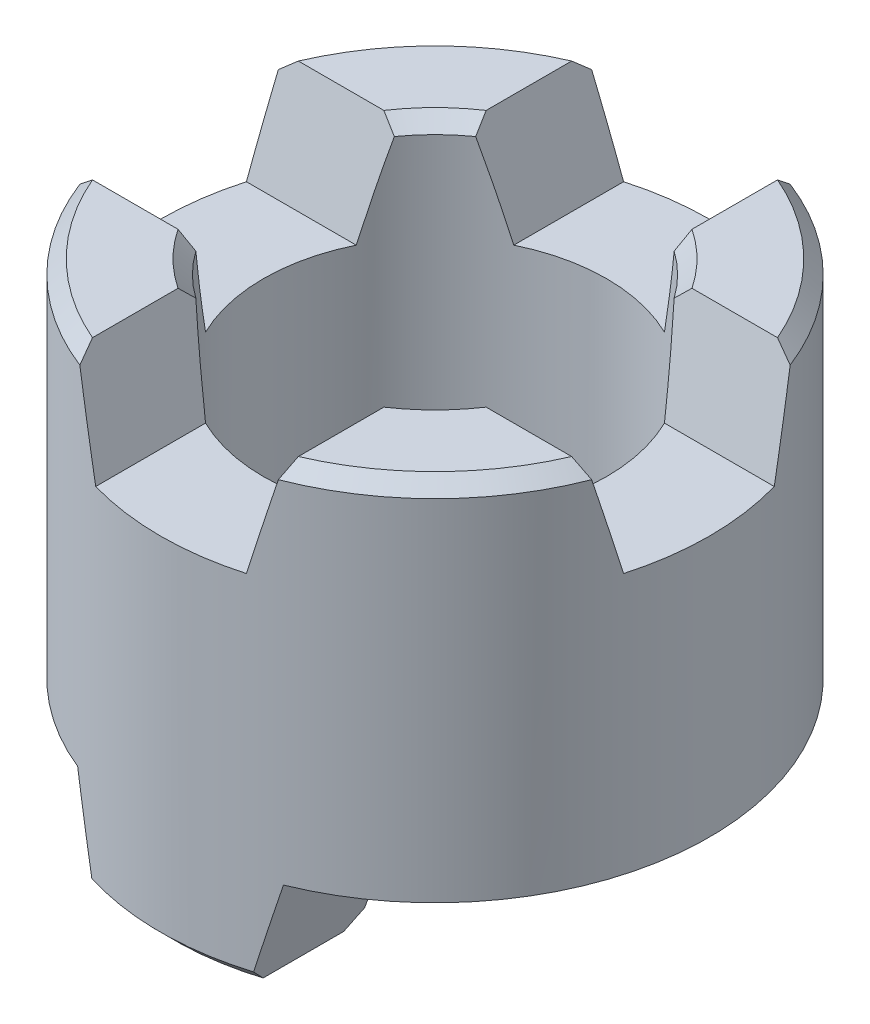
ISO-10303-21;
HEADER;
FILE_DESCRIPTION(('STEP AP214'),'2;1');
FILE_NAME('part.step','',(''),(''),'','','');
FILE_SCHEMA(('AUTOMOTIVE_DESIGN { 1 0 10303 214 1 1 1 1 }'));
ENDSEC;
DATA;
#1=APPLICATION_CONTEXT('core data for automotive mechanical design processes');
#2=APPLICATION_PROTOCOL_DEFINITION('international standard','automotive_design',2000,#1);
#3=PRODUCT_CONTEXT('',#1,'mechanical');
#4=PRODUCT('Part','Part','',(#3));
#5=PRODUCT_RELATED_PRODUCT_CATEGORY('part','',(#4));
#6=PRODUCT_DEFINITION_FORMATION('','',#4);
#7=PRODUCT_DEFINITION_CONTEXT('part definition',#1,'design');
#8=PRODUCT_DEFINITION('design','',#6,#7);
#9=PRODUCT_DEFINITION_SHAPE('','',#8);
#10=(LENGTH_UNIT() NAMED_UNIT(*) SI_UNIT(.MILLI.,.METRE.));
#11=(NAMED_UNIT(*) PLANE_ANGLE_UNIT() SI_UNIT($,.RADIAN.));
#12=(NAMED_UNIT(*) SI_UNIT($,.STERADIAN.) SOLID_ANGLE_UNIT());
#13=UNCERTAINTY_MEASURE_WITH_UNIT(LENGTH_MEASURE(1.E-05),#10,'distance_accuracy_value','');
#14=(GEOMETRIC_REPRESENTATION_CONTEXT(3) GLOBAL_UNCERTAINTY_ASSIGNED_CONTEXT((#13)) GLOBAL_UNIT_ASSIGNED_CONTEXT((#10,
#11,#12)) REPRESENTATION_CONTEXT('',''));
#15=CARTESIAN_POINT('',(0.,0.,0.));
#16=DIRECTION('',(0.,0.,1.));
#17=DIRECTION('',(1.,0.,0.));
#18=AXIS2_PLACEMENT_3D('',#15,#16,#17);
#19=CARTESIAN_POINT('',(25.534124,59.8136780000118,33.985099));
#20=DIRECTION('',(0.,1.,0.));
#21=DIRECTION('',(0.,0.,1.));
#22=AXIS2_PLACEMENT_3D('',#19,#20,#21);
#23=CONICAL_SURFACE('',#22,3.99999999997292,0.78539816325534);
#24=CARTESIAN_POINT('',(25.534124,59.8136780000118,33.985099));
#25=DIRECTION('',(0.,1.,0.));
#26=DIRECTION('',(-1.,0.,0.));
#27=AXIS2_PLACEMENT_3D('',#24,#25,#26);
#28=CIRCLE('',#27,3.99999999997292);
#29=CARTESIAN_POINT('',(26.7125849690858,59.8136780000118,37.8075628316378));
#30=VERTEX_POINT('',#29);
#31=CARTESIAN_POINT('',(24.3556630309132,59.8136780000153,37.8075628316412));
#32=VERTEX_POINT('',#31);
#33=EDGE_CURVE('E250',#30,#32,#28,.F.);
#34=ORIENTED_EDGE('',*,*,#33,.T.);
#35=CARTESIAN_POINT('',(24.3556630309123,59.8136780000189,37.8075628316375));
#36=CARTESIAN_POINT('',(24.3645947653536,59.780344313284,37.7754346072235));
#37=CARTESIAN_POINT('',(24.3735264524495,59.7470108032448,37.7433061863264));
#38=CARTESIAN_POINT('',(24.3913897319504,59.6803441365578,37.679048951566));
#39=CARTESIAN_POINT('',(24.4003213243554,59.6470109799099,37.6469201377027));
#40=CARTESIAN_POINT('',(24.4092528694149,59.6136779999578,37.6147911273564));
#41=B_SPLINE_CURVE_WITH_KNOTS('',3,(#35,#36,#37,#38,#39,#40),.UNSPECIFIED.,.F.,.F.,(4,2,4),(0.,
0.14145034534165,0.282900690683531),.UNSPECIFIED.);
#42=CARTESIAN_POINT('',(24.4092528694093,59.6136779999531,37.6147911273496));
#43=VERTEX_POINT('',#42);
#44=EDGE_CURVE('E253',#32,#43,#41,.T.);
#45=ORIENTED_EDGE('',*,*,#44,.T.);
#46=CARTESIAN_POINT('',(25.534124,59.6136779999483,33.985099));
#47=DIRECTION('',(0.,1.,0.));
#48=DIRECTION('',(0.,0.,1.));
#49=AXIS2_PLACEMENT_3D('',#46,#47,#48);
#50=CIRCLE('',#49,3.79999999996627);
#51=CARTESIAN_POINT('',(26.6589951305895,59.6136779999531,37.61479112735));
#52=VERTEX_POINT('',#51);
#53=EDGE_CURVE('E252',#52,#43,#50,.F.);
#54=ORIENTED_EDGE('',*,*,#53,.F.);
#55=CARTESIAN_POINT('',(26.6589951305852,59.6136779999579,37.6147911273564));
#56=CARTESIAN_POINT('',(26.6679266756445,59.6470109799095,37.6469201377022));
#57=CARTESIAN_POINT('',(26.6768582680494,59.6803441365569,37.6790489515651));
#58=CARTESIAN_POINT('',(26.69472154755,59.7470108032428,37.7433061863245));
#59=CARTESIAN_POINT('',(26.7036532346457,59.7803443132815,37.7754346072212));
#60=CARTESIAN_POINT('',(26.7125849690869,59.8136780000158,37.8075628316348));
#61=B_SPLINE_CURVE_WITH_KNOTS('',3,(#55,#56,#57,#58,#59,#60),.UNSPECIFIED.,.F.,.F.,(4,2,4),(0.,
0.141450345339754,0.282900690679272),.UNSPECIFIED.);
#62=EDGE_CURVE('E19',#52,#30,#61,.T.);
#63=ORIENTED_EDGE('',*,*,#62,.T.);
#64=EDGE_LOOP('',(#34,#45,#54,#63));
#65=FACE_BOUND('',#64,.T.);
#66=ADVANCED_FACE('F15',(#65),#23,.T.);
#67=CARTESIAN_POINT('',(25.3375684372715,59.613678,37.1314108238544));
#68=DIRECTION('',(0.,-1.,0.));
#69=DIRECTION('',(0.,0.,-1.));
#70=AXIS2_PLACEMENT_3D('',#67,#68,#69);
#71=PLANE('',#70);
#72=CARTESIAN_POINT('',(25.534124,59.6136780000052,33.985099));
#73=DIRECTION('',(0.,-1.,0.));
#74=DIRECTION('',(0.,0.,-1.));
#75=AXIS2_PLACEMENT_3D('',#72,#73,#74);
#76=CIRCLE('',#75,2.69999999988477);
#77=CARTESIAN_POINT('',(26.6589951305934,59.6136779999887,31.5305797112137));
#78=VERTEX_POINT('',#77);
#79=CARTESIAN_POINT('',(24.4092528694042,59.6136780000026,31.53057971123));
#80=VERTEX_POINT('',#79);
#81=EDGE_CURVE('E472',#78,#80,#76,.F.);
#82=ORIENTED_EDGE('',*,*,#81,.T.);
#83=DIRECTION('',(0.,0.,-1.));
#84=VECTOR('',#83,1.);
#85=CARTESIAN_POINT('',(24.4092528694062,59.613678,37.1314108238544));
#86=LINE('',#85,#84);
#87=CARTESIAN_POINT('',(24.4092528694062,59.6136779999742,30.3554068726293));
#88=VERTEX_POINT('',#87);
#89=EDGE_CURVE('E257',#80,#88,#86,.T.);
#90=ORIENTED_EDGE('',*,*,#89,.T.);
#91=CARTESIAN_POINT('',(25.534124,59.6136779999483,33.985099));
#92=DIRECTION('',(0.,1.,0.));
#93=DIRECTION('',(0.,0.,1.));
#94=AXIS2_PLACEMENT_3D('',#91,#92,#93);
#95=CIRCLE('',#94,3.79999999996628);
#96=CARTESIAN_POINT('',(26.6589951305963,59.6136779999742,30.3554068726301));
#97=VERTEX_POINT('',#96);
#98=EDGE_CURVE('E275',#97,#88,#95,.T.);
#99=ORIENTED_EDGE('',*,*,#98,.F.);
#100=DIRECTION('',(0.,0.,-1.));
#101=VECTOR('',#100,1.);
#102=CARTESIAN_POINT('',(26.6589951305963,59.613678,37.1314108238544));
#103=LINE('',#102,#101);
#104=EDGE_CURVE('E279',#97,#78,#103,.F.);
#105=ORIENTED_EDGE('',*,*,#104,.T.);
#106=EDGE_LOOP('',(#82,#90,#99,#105));
#107=FACE_BOUND('',#106,.T.);
#108=ADVANCED_FACE('F841',(#107),#71,.T.);
#109=CARTESIAN_POINT('',(25.3375684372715,59.613678,37.1314108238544));
#110=DIRECTION('',(0.,-1.,0.));
#111=DIRECTION('',(0.,0.,-1.));
#112=AXIS2_PLACEMENT_3D('',#109,#110,#111);
#113=PLANE('',#112);
#114=CARTESIAN_POINT('',(25.534124,59.6136780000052,33.985099));
#115=DIRECTION('',(0.,-1.,0.));
#116=DIRECTION('',(0.,0.,-1.));
#117=AXIS2_PLACEMENT_3D('',#114,#115,#116);
#118=CIRCLE('',#117,2.69999999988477);
#119=CARTESIAN_POINT('',(24.4092528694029,59.6136780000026,36.4396182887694));
#120=VERTEX_POINT('',#119);
#121=CARTESIAN_POINT('',(26.6589951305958,59.6136780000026,36.43961828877));
#122=VERTEX_POINT('',#121);
#123=EDGE_CURVE('E261',#120,#122,#118,.F.);
#124=ORIENTED_EDGE('',*,*,#123,.T.);
#125=DIRECTION('',(0.,0.,-1.));
#126=VECTOR('',#125,1.);
#127=CARTESIAN_POINT('',(26.6589951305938,59.613678,37.1314108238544));
#128=LINE('',#127,#126);
#129=EDGE_CURVE('E243',#122,#52,#128,.F.);
#130=ORIENTED_EDGE('',*,*,#129,.T.);
#131=ORIENTED_EDGE('',*,*,#53,.T.);
#132=DIRECTION('',(0.,0.,-1.));
#133=VECTOR('',#132,1.);
#134=CARTESIAN_POINT('',(24.4092528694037,59.613678,37.1314108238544));
#135=LINE('',#134,#133);
#136=EDGE_CURVE('E256',#43,#120,#135,.T.);
#137=ORIENTED_EDGE('',*,*,#136,.T.);
#138=EDGE_LOOP('',(#124,#130,#131,#137));
#139=FACE_BOUND('',#138,.T.);
#140=ADVANCED_FACE('F259',(#139),#113,.T.);
#141=CARTESIAN_POINT('',(27.7881475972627,66.313678,31.8450154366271));
#142=DIRECTION('',(0.,1.,0.));
#143=DIRECTION('',(0.,0.,1.));
#144=AXIS2_PLACEMENT_3D('',#141,#142,#143);
#145=PLANE('',#144);
#146=CARTESIAN_POINT('',(25.534124,66.3136780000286,33.985099));
#147=DIRECTION('',(0.,1.,0.));
#148=DIRECTION('',(0.,0.,1.));
#149=AXIS2_PLACEMENT_3D('',#146,#147,#148);
#150=CIRCLE('',#149,2.70000000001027);
#151=CARTESIAN_POINT('',(24.0341240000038,66.3136780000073,36.2300934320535));
#152=VERTEX_POINT('',#151);
#153=CARTESIAN_POINT('',(23.2891295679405,66.3136780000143,35.485099));
#154=VERTEX_POINT('',#153);
#155=EDGE_CURVE('E265',#152,#154,#150,.F.);
#156=ORIENTED_EDGE('',*,*,#155,.T.);
#157=DIRECTION('',(1.,0.,0.));
#158=VECTOR('',#157,1.);
#159=CARTESIAN_POINT('',(27.7881475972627,66.313678,35.485099));
#160=LINE('',#159,#158);
#161=CARTESIAN_POINT('',(22.0427059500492,66.3136779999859,35.4850989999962));
#162=VERTEX_POINT('',#161);
#163=EDGE_CURVE('E263',#154,#162,#160,.F.);
#164=ORIENTED_EDGE('',*,*,#163,.T.);
#165=CARTESIAN_POINT('',(25.534124,66.3136779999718,33.985099));
#166=DIRECTION('',(0.,-1.,0.));
#167=DIRECTION('',(0.,0.,-1.));
#168=AXIS2_PLACEMENT_3D('',#165,#166,#167);
#169=CIRCLE('',#168,3.79999999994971);
#170=CARTESIAN_POINT('',(24.0341240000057,66.3136779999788,37.4765170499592));
#171=VERTEX_POINT('',#170);
#172=EDGE_CURVE('E632',#171,#162,#169,.T.);
#173=ORIENTED_EDGE('',*,*,#172,.F.);
#174=DIRECTION('',(0.,0.,1.));
#175=VECTOR('',#174,1.);
#176=CARTESIAN_POINT('',(24.0341240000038,66.3136779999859,25.0434527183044));
#177=LINE('',#176,#175);
#178=EDGE_CURVE('E269',#171,#152,#177,.F.);
#179=ORIENTED_EDGE('',*,*,#178,.T.);
#180=EDGE_LOOP('',(#156,#164,#173,#179));
#181=FACE_BOUND('',#180,.T.);
#182=ADVANCED_FACE('F590',(#181),#145,.T.);
#183=CARTESIAN_POINT('',(25.534124,66.3136779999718,33.985099));
#184=DIRECTION('',(0.,1.,0.));
#185=DIRECTION('',(0.,0.,1.));
#186=AXIS2_PLACEMENT_3D('',#183,#184,#185);
#187=CONICAL_SURFACE('',#186,2.69999999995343,0.785398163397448);
#188=CARTESIAN_POINT('',(25.534124,66.113677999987,33.985099));
#189=DIRECTION('',(0.,1.,0.));
#190=DIRECTION('',(0.,0.,1.));
#191=AXIS2_PLACEMENT_3D('',#188,#189,#190);
#192=CIRCLE('',#191,2.5);
#193=CARTESIAN_POINT('',(24.0877138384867,66.1136779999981,36.0241913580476));
#194=VERTEX_POINT('',#193);
#195=CARTESIAN_POINT('',(23.4950316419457,66.1136779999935,35.431509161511));
#196=VERTEX_POINT('',#195);
#197=EDGE_CURVE('E463',#194,#196,#192,.F.);
#198=ORIENTED_EDGE('',*,*,#197,.T.);
#199=CARTESIAN_POINT('',(23.4950316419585,66.1136780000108,35.4315091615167));
#200=CARTESIAN_POINT('',(23.4606115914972,66.1469123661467,35.4404142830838));
#201=CARTESIAN_POINT('',(23.4262430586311,66.1801962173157,35.4493326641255));
#202=CARTESIAN_POINT('',(23.357609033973,66.2468628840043,35.4671959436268));
#203=CARTESIAN_POINT('',(23.3233435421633,66.2802456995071,35.4761408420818));
#204=CARTESIAN_POINT('',(23.2891295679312,66.3136780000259,35.4850990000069));
#205=B_SPLINE_CURVE_WITH_KNOTS('',3,(#199,#200,#201,#202,#203,#204),.UNSPECIFIED.,.F.,.F.,(4,2,
4),(0.,0.146003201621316,0.292006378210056),.UNSPECIFIED.);
#206=EDGE_CURVE('E602',#196,#154,#205,.T.);
#207=ORIENTED_EDGE('',*,*,#206,.T.);
#208=ORIENTED_EDGE('',*,*,#155,.F.);
#209=CARTESIAN_POINT('',(24.034123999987,66.3136780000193,36.2300934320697));
#210=CARTESIAN_POINT('',(24.0430821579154,66.2802456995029,36.1958794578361));
#211=CARTESIAN_POINT('',(24.0520270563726,66.2468628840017,36.1616139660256));
#212=CARTESIAN_POINT('',(24.0698903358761,66.1801962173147,36.0929799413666));
#213=CARTESIAN_POINT('',(24.0788087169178,66.1469123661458,36.0586114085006));
#214=CARTESIAN_POINT('',(24.0877138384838,66.1136780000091,36.0241913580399));
#215=B_SPLINE_CURVE_WITH_KNOTS('',3,(#209,#210,#211,#212,#213,#214),.UNSPECIFIED.,.F.,.F.,(4,2,
4),(0.,0.146003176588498,0.292006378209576),.UNSPECIFIED.);
#216=EDGE_CURVE('E595',#152,#194,#215,.T.);
#217=ORIENTED_EDGE('',*,*,#216,.T.);
#218=EDGE_LOOP('',(#198,#207,#208,#217));
#219=FACE_BOUND('',#218,.T.);
#220=ADVANCED_FACE('F586',(#219),#187,.F.);
#221=CARTESIAN_POINT('',(27.7881475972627,66.313678,31.8450154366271));
#222=DIRECTION('',(0.,1.,0.));
#223=DIRECTION('',(0.,0.,1.));
#224=AXIS2_PLACEMENT_3D('',#221,#222,#223);
#225=PLANE('',#224);
#226=CARTESIAN_POINT('',(25.534124,66.3136780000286,33.985099));
#227=DIRECTION('',(0.,1.,0.));
#228=DIRECTION('',(0.,0.,1.));
#229=AXIS2_PLACEMENT_3D('',#226,#227,#228);
#230=CIRCLE('',#229,2.70000000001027);
#231=CARTESIAN_POINT('',(23.2891295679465,66.3136780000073,32.4850990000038));
#232=VERTEX_POINT('',#231);
#233=CARTESIAN_POINT('',(24.034124,66.3136780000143,31.7401045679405));
#234=VERTEX_POINT('',#233);
#235=EDGE_CURVE('E467',#232,#234,#230,.F.);
#236=ORIENTED_EDGE('',*,*,#235,.T.);
#237=DIRECTION('',(0.,0.,1.));
#238=VECTOR('',#237,1.);
#239=CARTESIAN_POINT('',(24.034124,66.313678,31.8450154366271));
#240=LINE('',#239,#238);
#241=CARTESIAN_POINT('',(24.0341240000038,66.3136779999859,30.4936809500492));
#242=VERTEX_POINT('',#241);
#243=EDGE_CURVE('E470',#234,#242,#240,.F.);
#244=ORIENTED_EDGE('',*,*,#243,.T.);
#245=CARTESIAN_POINT('',(25.534124,66.3136779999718,33.985099));
#246=DIRECTION('',(0.,-1.,0.));
#247=DIRECTION('',(0.,0.,-1.));
#248=AXIS2_PLACEMENT_3D('',#245,#246,#247);
#249=CIRCLE('',#248,3.79999999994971);
#250=CARTESIAN_POINT('',(22.0427059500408,66.3136779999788,32.4850990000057));
#251=VERTEX_POINT('',#250);
#252=EDGE_CURVE('E512',#251,#242,#249,.T.);
#253=ORIENTED_EDGE('',*,*,#252,.F.);
#254=DIRECTION('',(1.,0.,0.));
#255=VECTOR('',#254,1.);
#256=CARTESIAN_POINT('',(31.6622326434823,66.3136779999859,32.4850990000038));
#257=LINE('',#256,#255);
#258=EDGE_CURVE('E458',#251,#232,#257,.T.);
#259=ORIENTED_EDGE('',*,*,#258,.T.);
#260=EDGE_LOOP('',(#236,#244,#253,#259));
#261=FACE_BOUND('',#260,.T.);
#262=ADVANCED_FACE('F580',(#261),#225,.T.);
#263=CARTESIAN_POINT('',(25.534124,59.8136780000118,33.985099));
#264=DIRECTION('',(0.,1.,0.));
#265=DIRECTION('',(0.,0.,1.));
#266=AXIS2_PLACEMENT_3D('',#263,#264,#265);
#267=CONICAL_SURFACE('',#266,3.99999999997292,0.78539816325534);
#268=CARTESIAN_POINT('',(25.534124,59.8136780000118,33.985099));
#269=DIRECTION('',(0.,1.,0.));
#270=DIRECTION('',(-1.,0.,0.));
#271=AXIS2_PLACEMENT_3D('',#268,#269,#270);
#272=CIRCLE('',#271,3.99999999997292);
#273=CARTESIAN_POINT('',(24.3556630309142,59.8136780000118,30.1626351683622));
#274=VERTEX_POINT('',#273);
#275=CARTESIAN_POINT('',(26.7125849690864,59.8136780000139,30.1626351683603));
#276=VERTEX_POINT('',#275);
#277=EDGE_CURVE('E271',#274,#276,#272,.F.);
#278=ORIENTED_EDGE('',*,*,#277,.T.);
#279=CARTESIAN_POINT('',(26.712584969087,59.8136780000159,30.1626351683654));
#280=CARTESIAN_POINT('',(26.7036532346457,59.7803443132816,30.1947633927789));
#281=CARTESIAN_POINT('',(26.69472154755,59.7470108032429,30.2268918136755));
#282=CARTESIAN_POINT('',(26.6768582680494,59.6803441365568,30.2911490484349));
#283=CARTESIAN_POINT('',(26.6679266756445,59.6470109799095,30.3232778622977));
#284=CARTESIAN_POINT('',(26.6589951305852,59.6136779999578,30.3554068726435));
#285=B_SPLINE_CURVE_WITH_KNOTS('',3,(#279,#280,#281,#282,#283,#284),.UNSPECIFIED.,.F.,.F.,(4,2,
4),(0.,0.141450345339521,0.282900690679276),.UNSPECIFIED.);
#286=EDGE_CURVE('E274',#276,#97,#285,.T.);
#287=ORIENTED_EDGE('',*,*,#286,.T.);
#288=ORIENTED_EDGE('',*,*,#98,.T.);
#289=CARTESIAN_POINT('',(24.4092528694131,59.6136779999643,30.3554068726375));
#290=CARTESIAN_POINT('',(24.4003213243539,59.6470109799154,30.3232778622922));
#291=CARTESIAN_POINT('',(24.3913897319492,59.6803441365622,30.2911490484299));
#292=CARTESIAN_POINT('',(24.3735264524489,59.747010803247,30.2268918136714));
#293=CARTESIAN_POINT('',(24.3645947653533,59.7803443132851,30.1947633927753));
#294=CARTESIAN_POINT('',(24.3556630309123,59.8136780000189,30.1626351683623));
#295=B_SPLINE_CURVE_WITH_KNOTS('',3,(#289,#290,#291,#292,#293,#294),.UNSPECIFIED.,.F.,.F.,(4,2,
4),(0.,0.141450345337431,0.282900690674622),.UNSPECIFIED.);
#296=EDGE_CURVE('E450',#88,#274,#295,.T.);
#297=ORIENTED_EDGE('',*,*,#296,.T.);
#298=EDGE_LOOP('',(#278,#287,#288,#297));
#299=FACE_BOUND('',#298,.T.);
#300=ADVANCED_FACE('F575',(#299),#267,.T.);
#301=CARTESIAN_POINT('',(25.534124,59.6136779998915,33.985099));
#302=DIRECTION('',(0.,-1.,0.));
#303=DIRECTION('',(0.,0.,-1.));
#304=AXIS2_PLACEMENT_3D('',#301,#302,#303);
#305=CONICAL_SURFACE('',#304,2.69999999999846,0.78539816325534);
#306=CARTESIAN_POINT('',(25.534124,59.8136779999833,33.985099));
#307=DIRECTION('',(0.,1.,0.));
#308=DIRECTION('',(0.,0.,1.));
#309=AXIS2_PLACEMENT_3D('',#306,#307,#308);
#310=CIRCLE('',#309,2.5);
#311=CARTESIAN_POINT('',(24.3556630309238,59.8136779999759,36.189918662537));
#312=VERTEX_POINT('',#311);
#313=CARTESIAN_POINT('',(26.712584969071,59.8136779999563,36.1899186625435));
#314=VERTEX_POINT('',#313);
#315=EDGE_CURVE('E465',#312,#314,#310,.T.);
#316=ORIENTED_EDGE('',*,*,#315,.T.);
#317=CARTESIAN_POINT('',(26.658995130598,59.6136779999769,36.4396182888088));
#318=CARTESIAN_POINT('',(26.6680414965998,59.647439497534,36.3983693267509));
#319=CARTESIAN_POINT('',(26.6770304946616,59.6809868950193,36.3569365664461));
#320=CARTESIAN_POINT('',(26.6948937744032,59.7476535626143,36.2737033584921));
#321=CARTESIAN_POINT('',(26.7037680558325,59.7807728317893,36.2319029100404));
#322=CARTESIAN_POINT('',(26.7125849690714,59.8136779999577,36.1899186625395));
#323=B_SPLINE_CURVE_WITH_KNOTS('',3,(#317,#318,#319,#320,#321,#322),.UNSPECIFIED.,.F.,.F.,(4,2,
4),(0.,0.162191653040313,0.324383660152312),.UNSPECIFIED.);
#324=EDGE_CURVE('E652',#122,#314,#323,.T.);
#325=ORIENTED_EDGE('',*,*,#324,.F.);
#326=ORIENTED_EDGE('',*,*,#123,.F.);
#327=CARTESIAN_POINT('',(24.409252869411,59.6136779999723,36.4396182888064));
#328=CARTESIAN_POINT('',(24.4002065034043,59.647439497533,36.398369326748));
#329=CARTESIAN_POINT('',(24.3912175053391,59.6809868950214,36.3569365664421));
#330=CARTESIAN_POINT('',(24.3733542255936,59.7476535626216,36.2737033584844));
#331=CARTESIAN_POINT('',(24.3644799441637,59.7807728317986,36.2319029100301));
#332=CARTESIAN_POINT('',(24.3556630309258,59.8136779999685,36.1899186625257));
#333=B_SPLINE_CURVE_WITH_KNOTS('',3,(#327,#328,#329,#330,#331,#332),.UNSPECIFIED.,.F.,.F.,(4,2,
4),(0.,0.162191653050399,0.324383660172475),.UNSPECIFIED.);
#334=EDGE_CURVE('E550',#120,#312,#333,.T.);
#335=ORIENTED_EDGE('',*,*,#334,.T.);
#336=EDGE_LOOP('',(#316,#325,#326,#335));
#337=FACE_BOUND('',#336,.T.);
#338=ADVANCED_FACE('F579',(#337),#305,.F.);
#339=CARTESIAN_POINT('',(25.534124,66.3136779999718,33.985099));
#340=DIRECTION('',(0.,1.,0.));
#341=DIRECTION('',(0.,0.,1.));
#342=AXIS2_PLACEMENT_3D('',#339,#340,#341);
#343=CONICAL_SURFACE('',#342,2.69999999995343,0.785398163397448);
#344=CARTESIAN_POINT('',(25.534124,66.1136779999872,33.985099));
#345=DIRECTION('',(0.,1.,0.));
#346=DIRECTION('',(0.,0.,1.));
#347=AXIS2_PLACEMENT_3D('',#344,#345,#346);
#348=CIRCLE('',#347,2.5);
#349=CARTESIAN_POINT('',(23.4950316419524,66.1136779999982,32.5386888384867));
#350=VERTEX_POINT('',#349);
#351=CARTESIAN_POINT('',(24.0877138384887,66.1136779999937,31.9460066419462));
#352=VERTEX_POINT('',#351);
#353=EDGE_CURVE('E460',#350,#352,#348,.F.);
#354=ORIENTED_EDGE('',*,*,#353,.T.);
#355=CARTESIAN_POINT('',(24.0877138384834,66.1136780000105,31.9460066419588));
#356=CARTESIAN_POINT('',(24.0788087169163,66.1469123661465,31.9115865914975));
#357=CARTESIAN_POINT('',(24.0698903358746,66.1801962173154,31.8772180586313));
#358=CARTESIAN_POINT('',(24.0520270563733,66.2468628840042,31.8085840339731));
#359=CARTESIAN_POINT('',(24.0430821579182,66.2802456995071,31.7743185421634));
#360=CARTESIAN_POINT('',(24.0341239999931,66.3136780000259,31.7401045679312));
#361=B_SPLINE_CURVE_WITH_KNOTS('',3,(#355,#356,#357,#358,#359,#360),.UNSPECIFIED.,.F.,.F.,(4,2,
4),(0.,0.146003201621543,0.292006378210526),.UNSPECIFIED.);
#362=EDGE_CURVE('E739',#352,#234,#361,.T.);
#363=ORIENTED_EDGE('',*,*,#362,.T.);
#364=ORIENTED_EDGE('',*,*,#235,.F.);
#365=CARTESIAN_POINT('',(23.2891295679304,66.3136780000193,32.485098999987));
#366=CARTESIAN_POINT('',(23.3233435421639,66.2802456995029,32.4940571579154));
#367=CARTESIAN_POINT('',(23.3576090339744,66.2468628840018,32.5030020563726));
#368=CARTESIAN_POINT('',(23.4262430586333,66.1801962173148,32.5208653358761));
#369=CARTESIAN_POINT('',(23.4606115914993,66.1469123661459,32.5297837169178));
#370=CARTESIAN_POINT('',(23.4950316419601,66.1136780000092,32.5386888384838));
#371=B_SPLINE_CURVE_WITH_KNOTS('',3,(#365,#366,#367,#368,#369,#370),.UNSPECIFIED.,.F.,.F.,(4,2,
4),(0.,0.146003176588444,0.292006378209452),.UNSPECIFIED.);
#372=EDGE_CURVE('E473',#232,#350,#371,.T.);
#373=ORIENTED_EDGE('',*,*,#372,.T.);
#374=EDGE_LOOP('',(#354,#363,#364,#373));
#375=FACE_BOUND('',#374,.T.);
#376=ADVANCED_FACE('F491',(#375),#343,.F.);
#377=CARTESIAN_POINT('',(25.534124,59.6136779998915,33.985099));
#378=DIRECTION('',(0.,-1.,0.));
#379=DIRECTION('',(0.,0.,-1.));
#380=AXIS2_PLACEMENT_3D('',#377,#378,#379);
#381=CONICAL_SURFACE('',#380,2.69999999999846,0.78539816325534);
#382=CARTESIAN_POINT('',(25.534124,59.8136779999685,33.985099));
#383=DIRECTION('',(0.,1.,0.));
#384=DIRECTION('',(0.,0.,1.));
#385=AXIS2_PLACEMENT_3D('',#382,#383,#384);
#386=CIRCLE('',#385,2.5);
#387=CARTESIAN_POINT('',(26.7125849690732,59.8136779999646,31.780279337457));
#388=VERTEX_POINT('',#387);
#389=CARTESIAN_POINT('',(24.3556630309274,59.8136779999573,31.7802793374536));
#390=VERTEX_POINT('',#389);
#391=EDGE_CURVE('E721',#388,#390,#386,.T.);
#392=ORIENTED_EDGE('',*,*,#391,.T.);
#393=CARTESIAN_POINT('',(24.3556630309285,59.8136779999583,31.7802793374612));
#394=CARTESIAN_POINT('',(24.364479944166,59.78077283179,31.7382950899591));
#395=CARTESIAN_POINT('',(24.3733542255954,59.7476535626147,31.696494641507));
#396=CARTESIAN_POINT('',(24.3912175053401,59.6809868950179,31.6132614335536));
#397=CARTESIAN_POINT('',(24.4002065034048,59.6474394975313,31.5718286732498));
#398=CARTESIAN_POINT('',(24.409252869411,59.6136779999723,31.5305797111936));
#399=B_SPLINE_CURVE_WITH_KNOTS('',3,(#393,#394,#395,#396,#397,#398),.UNSPECIFIED.,.F.,.F.,(4,2,
4),(0.,0.162192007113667,0.324383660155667),.UNSPECIFIED.);
#400=EDGE_CURVE('E518',#390,#80,#399,.T.);
#401=ORIENTED_EDGE('',*,*,#400,.T.);
#402=ORIENTED_EDGE('',*,*,#81,.F.);
#403=CARTESIAN_POINT('',(26.658995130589,59.6136779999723,31.5305797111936));
#404=CARTESIAN_POINT('',(26.6680414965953,59.6474394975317,31.5718286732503));
#405=CARTESIAN_POINT('',(26.6770304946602,59.6809868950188,31.6132614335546));
#406=CARTESIAN_POINT('',(26.694893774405,59.7476535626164,31.6964946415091));
#407=CARTESIAN_POINT('',(26.7037680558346,59.7807728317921,31.7382950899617));
#408=CARTESIAN_POINT('',(26.7125849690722,59.8136779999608,31.7802793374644));
#409=B_SPLINE_CURVE_WITH_KNOTS('',3,(#403,#404,#405,#406,#407,#408),.UNSPECIFIED.,.F.,.F.,(4,2,
4),(0.,0.162191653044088,0.324383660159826),.UNSPECIFIED.);
#410=EDGE_CURVE('E706',#78,#388,#409,.T.);
#411=ORIENTED_EDGE('',*,*,#410,.T.);
#412=EDGE_LOOP('',(#392,#401,#402,#411));
#413=FACE_BOUND('',#412,.T.);
#414=ADVANCED_FACE('F529',(#413),#381,.F.);
#415=CARTESIAN_POINT('',(24.034124,66.313678,25.0434527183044));
#416=DIRECTION('',(-0.965925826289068,-0.258819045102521,0.));
#417=DIRECTION('',(0.258819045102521,-0.965925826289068,0.));
#418=AXIS2_PLACEMENT_3D('',#415,#416,#417);
#419=PLANE('',#418);
#420=ORIENTED_EDGE('',*,*,#178,.F.);
#421=CARTESIAN_POINT('',(24.0877138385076,66.1136779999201,37.7144283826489));
#422=CARTESIAN_POINT('',(24.0787245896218,66.147226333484,37.674970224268));
#423=CARTESIAN_POINT('',(24.0697641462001,66.1806671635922,37.6354152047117));
#424=CARTESIAN_POINT('',(24.0519008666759,66.2473338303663,37.5561114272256));
#425=CARTESIAN_POINT('',(24.0429980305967,66.2805596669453,37.5163626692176));
#426=CARTESIAN_POINT('',(24.0341240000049,66.3136779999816,37.4765170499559));
#427=B_SPLINE_CURVE_WITH_KNOTS('',3,(#421,#422,#423,#424,#425,#426),.UNSPECIFIED.,.F.,.F.,(4,2,
4),(0.,0.157697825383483,0.315395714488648),.UNSPECIFIED.);
#428=CARTESIAN_POINT('',(24.0877138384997,66.1136779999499,37.7144283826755));
#429=VERTEX_POINT('',#428);
#430=EDGE_CURVE('E627',#429,#171,#427,.T.);
#431=ORIENTED_EDGE('',*,*,#430,.F.);
#432=CARTESIAN_POINT('',(25.534124,60.7156017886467,33.985099));
#433=DIRECTION('',(-0.965925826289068,-0.258819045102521,0.));
#434=DIRECTION('',(0.258819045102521,-0.965925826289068,0.));
#435=AXIS2_PLACEMENT_3D('',#432,#433,#434);
#436=ELLIPSE('',#435,15.4548132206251,4.00000000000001);
#437=CARTESIAN_POINT('',(24.4360477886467,64.813678,37.8314256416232));
#438=VERTEX_POINT('',#437);
#439=EDGE_CURVE('E702',#438,#429,#436,.T.);
#440=ORIENTED_EDGE('',*,*,#439,.F.);
#441=DIRECTION('',(0.,0.,1.));
#442=VECTOR('',#441,1.);
#443=CARTESIAN_POINT('',(24.4360477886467,64.813678,31.8450154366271));
#444=LINE('',#443,#442);
#445=CARTESIAN_POINT('',(24.4360477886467,64.813678,36.2310350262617));
#446=VERTEX_POINT('',#445);
#447=EDGE_CURVE('E649',#446,#438,#444,.T.);
#448=ORIENTED_EDGE('',*,*,#447,.F.);
#449=CARTESIAN_POINT('',(25.534124,60.7156017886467,33.985099));
#450=DIRECTION('',(-0.965925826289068,-0.258819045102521,0.));
#451=DIRECTION('',(-0.258819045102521,0.965925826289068,0.));
#452=AXIS2_PLACEMENT_3D('',#449,#450,#451);
#453=ELLIPSE('',#452,9.65925826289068,2.5);
#454=EDGE_CURVE('E462',#194,#446,#453,.F.);
#455=ORIENTED_EDGE('',*,*,#454,.F.);
#456=ORIENTED_EDGE('',*,*,#216,.F.);
#457=EDGE_LOOP('',(#420,#431,#440,#448,#455,#456));
#458=FACE_BOUND('',#457,.T.);
#459=ADVANCED_FACE('F623',(#458),#419,.F.);
#460=CARTESIAN_POINT('',(25.534124,66.1136779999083,33.985099));
#461=DIRECTION('',(0.,-1.,0.));
#462=DIRECTION('',(0.,0.,-1.));
#463=AXIS2_PLACEMENT_3D('',#460,#461,#462);
#464=CONICAL_SURFACE('',#463,3.99999999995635,0.78539816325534);
#465=ORIENTED_EDGE('',*,*,#172,.T.);
#466=CARTESIAN_POINT('',(22.0427059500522,66.3136779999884,35.4850989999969));
#467=CARTESIAN_POINT('',(22.0028603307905,66.2805596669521,35.4762249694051));
#468=CARTESIAN_POINT('',(21.9631115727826,66.2473338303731,35.467322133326));
#469=CARTESIAN_POINT('',(21.8838077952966,66.1806671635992,35.4494588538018));
#470=CARTESIAN_POINT('',(21.8442527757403,66.147226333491,35.4404984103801));
#471=CARTESIAN_POINT('',(21.8047946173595,66.1136779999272,35.4315091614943));
#472=B_SPLINE_CURVE_WITH_KNOTS('',3,(#466,#467,#468,#469,#470,#471),.UNSPECIFIED.,.F.,.F.,(4,2,
4),(0.,0.157697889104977,0.315395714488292),.UNSPECIFIED.);
#473=CARTESIAN_POINT('',(21.8047946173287,66.1136779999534,35.4315091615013));
#474=VERTEX_POINT('',#473);
#475=EDGE_CURVE('E608',#162,#474,#472,.T.);
#476=ORIENTED_EDGE('',*,*,#475,.T.);
#477=CARTESIAN_POINT('',(25.534124,66.1136779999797,33.985099));
#478=DIRECTION('',(0.,-1.,0.));
#479=DIRECTION('',(0.,0.,-1.));
#480=AXIS2_PLACEMENT_3D('',#477,#478,#479);
#481=CIRCLE('',#480,4.00000000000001);
#482=EDGE_CURVE('E698',#429,#474,#481,.T.);
#483=ORIENTED_EDGE('',*,*,#482,.F.);
#484=ORIENTED_EDGE('',*,*,#430,.T.);
#485=EDGE_LOOP('',(#465,#476,#483,#484));
#486=FACE_BOUND('',#485,.T.);
#487=ADVANCED_FACE('F618',(#486),#464,.T.);
#488=CARTESIAN_POINT('',(20.4852811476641,66.313678,35.485099));
#489=DIRECTION('',(0.,-0.258819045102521,0.965925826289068));
#490=DIRECTION('',(0.,-0.965925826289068,-0.258819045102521));
#491=AXIS2_PLACEMENT_3D('',#488,#489,#490);
#492=PLANE('',#491);
#493=ORIENTED_EDGE('',*,*,#163,.F.);
#494=ORIENTED_EDGE('',*,*,#206,.F.);
#495=CARTESIAN_POINT('',(25.534124,60.7156017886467,33.985099));
#496=DIRECTION('',(0.,-0.258819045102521,0.965925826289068));
#497=DIRECTION('',(0.,0.965925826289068,0.258819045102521));
#498=AXIS2_PLACEMENT_3D('',#495,#496,#497);
#499=ELLIPSE('',#498,9.65925826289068,2.5);
#500=CARTESIAN_POINT('',(23.2881879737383,64.813678,35.0831752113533));
#501=VERTEX_POINT('',#500);
#502=EDGE_CURVE('E609',#501,#196,#499,.F.);
#503=ORIENTED_EDGE('',*,*,#502,.F.);
#504=DIRECTION('',(1.,0.,0.));
#505=VECTOR('',#504,1.);
#506=CARTESIAN_POINT('',(28.1845767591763,64.813678,35.0831752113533));
#507=LINE('',#506,#505);
#508=CARTESIAN_POINT('',(21.6877973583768,64.813678,35.0831752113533));
#509=VERTEX_POINT('',#508);
#510=EDGE_CURVE('E455',#509,#501,#507,.T.);
#511=ORIENTED_EDGE('',*,*,#510,.F.);
#512=CARTESIAN_POINT('',(25.534124,60.7156017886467,33.985099));
#513=DIRECTION('',(0.,-0.258819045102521,0.965925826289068));
#514=DIRECTION('',(0.,-0.965925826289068,-0.258819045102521));
#515=AXIS2_PLACEMENT_3D('',#512,#513,#514);
#516=ELLIPSE('',#515,15.4548132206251,4.00000000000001);
#517=EDGE_CURVE('E701',#474,#509,#516,.T.);
#518=ORIENTED_EDGE('',*,*,#517,.F.);
#519=ORIENTED_EDGE('',*,*,#475,.F.);
#520=EDGE_LOOP('',(#493,#494,#503,#511,#518,#519));
#521=FACE_BOUND('',#520,.T.);
#522=ADVANCED_FACE('F615',(#521),#492,.F.);
#523=CARTESIAN_POINT('',(28.1845767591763,64.813678,32.0039853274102));
#524=DIRECTION('',(0.,1.,0.));
#525=DIRECTION('',(0.,0.,1.));
#526=AXIS2_PLACEMENT_3D('',#523,#524,#525);
#527=PLANE('',#526);
#528=CARTESIAN_POINT('',(25.534124,64.813678,33.985099));
#529=DIRECTION('',(0.,-1.,0.));
#530=DIRECTION('',(0.,0.,-1.));
#531=AXIS2_PLACEMENT_3D('',#528,#529,#530);
#532=CIRCLE('',#531,4.00000000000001);
#533=CARTESIAN_POINT('',(21.6877973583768,64.813678,32.8870227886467));
#534=VERTEX_POINT('',#533);
#535=EDGE_CURVE('E769',#509,#534,#532,.T.);
#536=ORIENTED_EDGE('',*,*,#535,.F.);
#537=ORIENTED_EDGE('',*,*,#510,.T.);
#538=CARTESIAN_POINT('',(25.534124,64.813678,33.985099));
#539=DIRECTION('',(0.,1.,0.));
#540=DIRECTION('',(0.,0.,1.));
#541=AXIS2_PLACEMENT_3D('',#538,#539,#540);
#542=CIRCLE('',#541,2.5);
#543=CARTESIAN_POINT('',(23.2881879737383,64.813678,32.8870227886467));
#544=VERTEX_POINT('',#543);
#545=EDGE_CURVE('E459',#501,#544,#542,.F.);
#546=ORIENTED_EDGE('',*,*,#545,.T.);
#547=DIRECTION('',(1.,0.,0.));
#548=VECTOR('',#547,1.);
#549=CARTESIAN_POINT('',(31.6622326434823,64.813678,32.8870227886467));
#550=LINE('',#549,#548);
#551=EDGE_CURVE('E451',#544,#534,#550,.F.);
#552=ORIENTED_EDGE('',*,*,#551,.T.);
#553=EDGE_LOOP('',(#536,#537,#546,#552));
#554=FACE_BOUND('',#553,.T.);
#555=ADVANCED_FACE('F501',(#554),#527,.T.);
#556=CARTESIAN_POINT('',(31.6622326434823,66.313678,32.485099));
#557=DIRECTION('',(0.,-0.258819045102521,-0.965925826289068));
#558=DIRECTION('',(0.,0.965925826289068,-0.258819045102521));
#559=AXIS2_PLACEMENT_3D('',#556,#557,#558);
#560=PLANE('',#559);
#561=CARTESIAN_POINT('',(25.534124,60.7156017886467,33.985099));
#562=DIRECTION('',(0.,-0.258819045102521,-0.965925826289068));
#563=DIRECTION('',(0.,-0.965925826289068,0.258819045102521));
#564=AXIS2_PLACEMENT_3D('',#561,#562,#563);
#565=ELLIPSE('',#564,15.4548132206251,4.00000000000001);
#566=CARTESIAN_POINT('',(21.8047946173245,66.1136779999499,32.5386888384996));
#567=VERTEX_POINT('',#566);
#568=EDGE_CURVE('E697',#534,#567,#565,.T.);
#569=ORIENTED_EDGE('',*,*,#568,.F.);
#570=ORIENTED_EDGE('',*,*,#551,.F.);
#571=CARTESIAN_POINT('',(25.534124,60.7156017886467,33.985099));
#572=DIRECTION('',(0.,-0.258819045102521,-0.965925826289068));
#573=DIRECTION('',(0.,0.965925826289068,-0.258819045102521));
#574=AXIS2_PLACEMENT_3D('',#571,#572,#573);
#575=ELLIPSE('',#574,9.65925826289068,2.5);
#576=EDGE_CURVE('E454',#350,#544,#575,.F.);
#577=ORIENTED_EDGE('',*,*,#576,.F.);
#578=ORIENTED_EDGE('',*,*,#372,.F.);
#579=ORIENTED_EDGE('',*,*,#258,.F.);
#580=CARTESIAN_POINT('',(21.8047946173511,66.1136779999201,32.5386888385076));
#581=CARTESIAN_POINT('',(21.844252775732,66.147226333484,32.5296995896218));
#582=CARTESIAN_POINT('',(21.8838077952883,66.1806671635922,32.5207391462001));
#583=CARTESIAN_POINT('',(21.9631115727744,66.2473338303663,32.5028758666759));
#584=CARTESIAN_POINT('',(22.0028603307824,66.2805596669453,32.4939730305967));
#585=CARTESIAN_POINT('',(22.0427059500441,66.3136779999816,32.4850990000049));
#586=B_SPLINE_CURVE_WITH_KNOTS('',3,(#580,#581,#582,#583,#584,#585),.UNSPECIFIED.,.F.,.F.,(4,2,
4),(0.,0.1576978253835,0.315395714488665),.UNSPECIFIED.);
#587=EDGE_CURVE('E453',#567,#251,#586,.T.);
#588=ORIENTED_EDGE('',*,*,#587,.F.);
#589=EDGE_LOOP('',(#569,#570,#577,#578,#579,#588));
#590=FACE_BOUND('',#589,.T.);
#591=ADVANCED_FACE('F495',(#590),#560,.F.);
#592=CARTESIAN_POINT('',(25.534124,66.1136779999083,33.985099));
#593=DIRECTION('',(0.,-1.,0.));
#594=DIRECTION('',(0.,0.,-1.));
#595=AXIS2_PLACEMENT_3D('',#592,#593,#594);
#596=CONICAL_SURFACE('',#595,3.99999999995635,0.78539816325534);
#597=ORIENTED_EDGE('',*,*,#252,.T.);
#598=CARTESIAN_POINT('',(24.0341240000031,66.3136779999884,30.4936809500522));
#599=CARTESIAN_POINT('',(24.0429980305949,66.2805596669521,30.4538353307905));
#600=CARTESIAN_POINT('',(24.051900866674,66.2473338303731,30.4140865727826));
#601=CARTESIAN_POINT('',(24.0697641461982,66.1806671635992,30.3347827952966));
#602=CARTESIAN_POINT('',(24.0787245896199,66.147226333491,30.2952277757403));
#603=CARTESIAN_POINT('',(24.0877138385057,66.1136779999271,30.2557696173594));
#604=B_SPLINE_CURVE_WITH_KNOTS('',3,(#598,#599,#600,#601,#602,#603),.UNSPECIFIED.,.F.,.F.,(4,2,
4),(0.,0.157697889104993,0.315395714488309),.UNSPECIFIED.);
#605=CARTESIAN_POINT('',(24.0877138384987,66.1136779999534,30.2557696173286));
#606=VERTEX_POINT('',#605);
#607=EDGE_CURVE('E732',#242,#606,#604,.T.);
#608=ORIENTED_EDGE('',*,*,#607,.T.);
#609=CARTESIAN_POINT('',(25.534124,66.1136779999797,33.985099));
#610=DIRECTION('',(0.,-1.,0.));
#611=DIRECTION('',(0.,0.,-1.));
#612=AXIS2_PLACEMENT_3D('',#609,#610,#611);
#613=CIRCLE('',#612,4.00000000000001);
#614=EDGE_CURVE('E693',#567,#606,#613,.T.);
#615=ORIENTED_EDGE('',*,*,#614,.F.);
#616=ORIENTED_EDGE('',*,*,#587,.T.);
#617=EDGE_LOOP('',(#597,#608,#615,#616));
#618=FACE_BOUND('',#617,.T.);
#619=ADVANCED_FACE('F500',(#618),#596,.T.);
#620=CARTESIAN_POINT('',(24.3964706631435,59.6613818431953,27.3974286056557));
#621=DIRECTION('',(0.965925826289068,0.258819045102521,0.));
#622=DIRECTION('',(-0.258819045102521,0.965925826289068,0.));
#623=AXIS2_PLACEMENT_3D('',#620,#621,#622);
#624=PLANE('',#623);
#625=CARTESIAN_POINT('',(25.534124,55.4156017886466,33.985099));
#626=DIRECTION('',(0.965925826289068,0.258819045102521,0.));
#627=DIRECTION('',(0.258819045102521,-0.965925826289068,0.));
#628=AXIS2_PLACEMENT_3D('',#625,#626,#627);
#629=ELLIPSE('',#628,15.4548132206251,4.00000000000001);
#630=CARTESIAN_POINT('',(24.034124,61.013678,30.2769997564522));
#631=VERTEX_POINT('',#630);
#632=EDGE_CURVE('E761',#274,#631,#629,.T.);
#633=ORIENTED_EDGE('',*,*,#632,.F.);
#634=ORIENTED_EDGE('',*,*,#296,.F.);
#635=ORIENTED_EDGE('',*,*,#89,.F.);
#636=ORIENTED_EDGE('',*,*,#400,.F.);
#637=CARTESIAN_POINT('',(25.534124,55.4156017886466,33.985099));
#638=DIRECTION('',(0.965925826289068,0.258819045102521,0.));
#639=DIRECTION('',(-0.258819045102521,0.965925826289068,0.));
#640=AXIS2_PLACEMENT_3D('',#637,#638,#639);
#641=ELLIPSE('',#640,9.65925826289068,2.5);
#642=CARTESIAN_POINT('',(24.034124,61.013678,31.985099));
#643=VERTEX_POINT('',#642);
#644=EDGE_CURVE('E515',#643,#390,#641,.F.);
#645=ORIENTED_EDGE('',*,*,#644,.F.);
#646=DIRECTION('',(0.,0.,-1.));
#647=VECTOR('',#646,1.);
#648=CARTESIAN_POINT('',(24.034124,61.013678,37.1314108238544));
#649=LINE('',#648,#647);
#650=EDGE_CURVE('E446',#631,#643,#649,.F.);
#651=ORIENTED_EDGE('',*,*,#650,.F.);
#652=EDGE_LOOP('',(#633,#634,#635,#636,#645,#651));
#653=FACE_BOUND('',#652,.T.);
#654=ADVANCED_FACE('F532',(#653),#624,.F.);
#655=CARTESIAN_POINT('',(25.3375684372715,61.013678,37.1314108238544));
#656=DIRECTION('',(0.,-1.,0.));
#657=DIRECTION('',(0.,0.,-1.));
#658=AXIS2_PLACEMENT_3D('',#655,#656,#657);
#659=PLANE('',#658);
#660=CARTESIAN_POINT('',(25.534124,61.013678,33.985099));
#661=DIRECTION('',(0.,1.,0.));
#662=DIRECTION('',(0.,0.,1.));
#663=AXIS2_PLACEMENT_3D('',#660,#661,#662);
#664=CIRCLE('',#663,2.5);
#665=CARTESIAN_POINT('',(24.034124,61.013678,35.985099));
#666=VERTEX_POINT('',#665);
#667=EDGE_CURVE('E449',#643,#666,#664,.T.);
#668=ORIENTED_EDGE('',*,*,#667,.T.);
#669=DIRECTION('',(0.,0.,1.));
#670=VECTOR('',#669,1.);
#671=CARTESIAN_POINT('',(24.034124,61.013678,27.3974286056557));
#672=LINE('',#671,#670);
#673=CARTESIAN_POINT('',(24.034124,61.013678,37.6931982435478));
#674=VERTEX_POINT('',#673);
#675=EDGE_CURVE('E442',#666,#674,#672,.T.);
#676=ORIENTED_EDGE('',*,*,#675,.T.);
#677=CARTESIAN_POINT('',(25.534124,61.013678,33.985099));
#678=DIRECTION('',(0.,-1.,0.));
#679=DIRECTION('',(0.,0.,-1.));
#680=AXIS2_PLACEMENT_3D('',#677,#678,#679);
#681=CIRCLE('',#680,4.00000000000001);
#682=EDGE_CURVE('E757',#631,#674,#681,.F.);
#683=ORIENTED_EDGE('',*,*,#682,.F.);
#684=ORIENTED_EDGE('',*,*,#650,.T.);
#685=EDGE_LOOP('',(#668,#676,#683,#684));
#686=FACE_BOUND('',#685,.T.);
#687=ADVANCED_FACE('F536',(#686),#659,.T.);
#688=CARTESIAN_POINT('',(24.3964706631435,59.6613818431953,27.3974286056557));
#689=DIRECTION('',(0.965925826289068,0.258819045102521,0.));
#690=DIRECTION('',(-0.258819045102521,0.965925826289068,0.));
#691=AXIS2_PLACEMENT_3D('',#688,#689,#690);
#692=PLANE('',#691);
#693=CARTESIAN_POINT('',(25.534124,55.4156017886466,33.985099));
#694=DIRECTION('',(0.965925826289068,0.258819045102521,0.));
#695=DIRECTION('',(-0.258819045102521,0.965925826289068,0.));
#696=AXIS2_PLACEMENT_3D('',#693,#694,#695);
#697=ELLIPSE('',#696,9.65925826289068,2.5);
#698=EDGE_CURVE('E445',#312,#666,#697,.F.);
#699=ORIENTED_EDGE('',*,*,#698,.F.);
#700=ORIENTED_EDGE('',*,*,#334,.F.);
#701=ORIENTED_EDGE('',*,*,#136,.F.);
#702=ORIENTED_EDGE('',*,*,#44,.F.);
#703=CARTESIAN_POINT('',(25.534124,55.4156017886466,33.985099));
#704=DIRECTION('',(0.965925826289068,0.258819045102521,0.));
#705=DIRECTION('',(0.258819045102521,-0.965925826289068,0.));
#706=AXIS2_PLACEMENT_3D('',#703,#704,#705);
#707=ELLIPSE('',#706,15.4548132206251,4.00000000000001);
#708=EDGE_CURVE('E755',#674,#32,#707,.T.);
#709=ORIENTED_EDGE('',*,*,#708,.F.);
#710=ORIENTED_EDGE('',*,*,#675,.F.);
#711=EDGE_LOOP('',(#699,#700,#701,#702,#709,#710));
#712=FACE_BOUND('',#711,.T.);
#713=ADVANCED_FACE('F541',(#712),#692,.F.);
#714=CARTESIAN_POINT('',(24.034124,66.313678,25.0434527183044));
#715=DIRECTION('',(-0.965925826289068,-0.258819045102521,0.));
#716=DIRECTION('',(0.258819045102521,-0.965925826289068,0.));
#717=AXIS2_PLACEMENT_3D('',#714,#715,#716);
#718=PLANE('',#717);
#719=ORIENTED_EDGE('',*,*,#243,.F.);
#720=ORIENTED_EDGE('',*,*,#362,.F.);
#721=CARTESIAN_POINT('',(25.534124,60.7156017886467,33.985099));
#722=DIRECTION('',(-0.965925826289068,-0.258819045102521,0.));
#723=DIRECTION('',(-0.258819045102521,0.965925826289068,0.));
#724=AXIS2_PLACEMENT_3D('',#721,#722,#723);
#725=ELLIPSE('',#724,9.65925826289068,2.5);
#726=CARTESIAN_POINT('',(24.4360477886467,64.813678,31.7391629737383));
#727=VERTEX_POINT('',#726);
#728=EDGE_CURVE('E444',#727,#352,#725,.F.);
#729=ORIENTED_EDGE('',*,*,#728,.F.);
#730=DIRECTION('',(0.,0.,1.));
#731=VECTOR('',#730,1.);
#732=CARTESIAN_POINT('',(24.4360477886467,64.813678,31.8450154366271));
#733=LINE('',#732,#731);
#734=CARTESIAN_POINT('',(24.4360477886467,64.813678,30.1387723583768));
#735=VERTEX_POINT('',#734);
#736=EDGE_CURVE('E430',#735,#727,#733,.T.);
#737=ORIENTED_EDGE('',*,*,#736,.F.);
#738=CARTESIAN_POINT('',(25.534124,60.7156017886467,33.985099));
#739=DIRECTION('',(-0.965925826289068,-0.258819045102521,0.));
#740=DIRECTION('',(0.258819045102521,-0.965925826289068,0.));
#741=AXIS2_PLACEMENT_3D('',#738,#739,#740);
#742=ELLIPSE('',#741,15.4548132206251,4.00000000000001);
#743=EDGE_CURVE('E696',#606,#735,#742,.T.);
#744=ORIENTED_EDGE('',*,*,#743,.F.);
#745=ORIENTED_EDGE('',*,*,#607,.F.);
#746=EDGE_LOOP('',(#719,#720,#729,#737,#744,#745));
#747=FACE_BOUND('',#746,.T.);
#748=ADVANCED_FACE('F545',(#747),#718,.F.);
#749=CARTESIAN_POINT('',(27.7881475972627,66.313678,31.8450154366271));
#750=DIRECTION('',(0.,1.,0.));
#751=DIRECTION('',(0.,0.,1.));
#752=AXIS2_PLACEMENT_3D('',#749,#750,#751);
#753=PLANE('',#752);
#754=CARTESIAN_POINT('',(25.534124,66.3136780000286,33.985099));
#755=DIRECTION('',(0.,1.,0.));
#756=DIRECTION('',(0.,0.,1.));
#757=AXIS2_PLACEMENT_3D('',#754,#755,#756);
#758=CIRCLE('',#757,2.70000000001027);
#759=CARTESIAN_POINT('',(27.0341239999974,66.3136780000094,31.7401045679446));
#760=VERTEX_POINT('',#759);
#761=CARTESIAN_POINT('',(27.7791184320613,66.3136780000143,32.4850990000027));
#762=VERTEX_POINT('',#761);
#763=EDGE_CURVE('E728',#760,#762,#758,.F.);
#764=ORIENTED_EDGE('',*,*,#763,.T.);
#765=DIRECTION('',(1.,0.,0.));
#766=VECTOR('',#765,1.);
#767=CARTESIAN_POINT('',(27.7881475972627,66.313678,32.4850990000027));
#768=LINE('',#767,#766);
#769=CARTESIAN_POINT('',(29.0255420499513,66.3136779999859,32.4850990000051));
#770=VERTEX_POINT('',#769);
#771=EDGE_CURVE('E440',#762,#770,#768,.T.);
#772=ORIENTED_EDGE('',*,*,#771,.T.);
#773=CARTESIAN_POINT('',(25.534124,66.3136779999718,33.985099));
#774=DIRECTION('',(0.,-1.,0.));
#775=DIRECTION('',(0.,0.,-1.));
#776=AXIS2_PLACEMENT_3D('',#773,#774,#775);
#777=CIRCLE('',#776,3.79999999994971);
#778=CARTESIAN_POINT('',(27.0341239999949,66.313677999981,30.4936809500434));
#779=VERTEX_POINT('',#778);
#780=EDGE_CURVE('E418',#779,#770,#777,.T.);
#781=ORIENTED_EDGE('',*,*,#780,.F.);
#782=DIRECTION('',(0.,0.,1.));
#783=VECTOR('',#782,1.);
#784=CARTESIAN_POINT('',(27.0341239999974,66.3136779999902,40.997808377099));
#785=LINE('',#784,#783);
#786=EDGE_CURVE('E427',#779,#760,#785,.T.);
#787=ORIENTED_EDGE('',*,*,#786,.T.);
#788=EDGE_LOOP('',(#764,#772,#781,#787));
#789=FACE_BOUND('',#788,.T.);
#790=ADVANCED_FACE('F371',(#789),#753,.T.);
#791=CARTESIAN_POINT('',(25.534124,66.3136779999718,33.985099));
#792=DIRECTION('',(0.,1.,0.));
#793=DIRECTION('',(0.,0.,1.));
#794=AXIS2_PLACEMENT_3D('',#791,#792,#793);
#795=CONICAL_SURFACE('',#794,2.69999999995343,0.785398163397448);
#796=CARTESIAN_POINT('',(25.534124,66.1136779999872,33.985099));
#797=DIRECTION('',(0.,1.,0.));
#798=DIRECTION('',(0.,0.,1.));
#799=AXIS2_PLACEMENT_3D('',#796,#797,#798);
#800=CIRCLE('',#799,2.5);
#801=CARTESIAN_POINT('',(26.9805341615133,66.1136779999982,31.9460066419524));
#802=VERTEX_POINT('',#801);
#803=CARTESIAN_POINT('',(27.5732163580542,66.1136779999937,32.538688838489));
#804=VERTEX_POINT('',#803);
#805=EDGE_CURVE('E726',#802,#804,#800,.F.);
#806=ORIENTED_EDGE('',*,*,#805,.T.);
#807=CARTESIAN_POINT('',(27.5732163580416,66.1136780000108,32.5386888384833));
#808=CARTESIAN_POINT('',(27.6076364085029,66.1469123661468,32.5297837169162));
#809=CARTESIAN_POINT('',(27.6420049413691,66.1801962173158,32.5208653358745));
#810=CARTESIAN_POINT('',(27.7106389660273,66.2468628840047,32.5030020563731));
#811=CARTESIAN_POINT('',(27.7449044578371,66.2802456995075,32.4940571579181));
#812=CARTESIAN_POINT('',(27.7791184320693,66.3136780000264,32.4850989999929));
#813=B_SPLINE_CURVE_WITH_KNOTS('',3,(#807,#808,#809,#810,#811,#812),.UNSPECIFIED.,.F.,.F.,(4,2,
4),(0.,0.14600320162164,0.292006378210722),.UNSPECIFIED.);
#814=EDGE_CURVE('E384',#804,#762,#813,.T.);
#815=ORIENTED_EDGE('',*,*,#814,.T.);
#816=ORIENTED_EDGE('',*,*,#763,.F.);
#817=CARTESIAN_POINT('',(27.0341240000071,66.3136780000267,31.7401045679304));
#818=CARTESIAN_POINT('',(27.0251658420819,66.2802456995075,31.774318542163));
#819=CARTESIAN_POINT('',(27.0162209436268,66.2468628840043,31.808584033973));
#820=CARTESIAN_POINT('',(26.9983576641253,66.1801962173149,31.8772180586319));
#821=CARTESIAN_POINT('',(26.9894392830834,66.1469123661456,31.9115865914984));
#822=CARTESIAN_POINT('',(26.9805341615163,66.1136780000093,31.94600664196));
#823=B_SPLINE_CURVE_WITH_KNOTS('',3,(#817,#818,#819,#820,#821,#822),.UNSPECIFIED.,.F.,.F.,(4,2,
4),(0.,0.146003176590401,0.292006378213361),.UNSPECIFIED.);
#824=EDGE_CURVE('E376',#760,#802,#823,.T.);
#825=ORIENTED_EDGE('',*,*,#824,.T.);
#826=EDGE_LOOP('',(#806,#815,#816,#825));
#827=FACE_BOUND('',#826,.T.);
#828=ADVANCED_FACE('F366',(#827),#795,.F.);
#829=CARTESIAN_POINT('',(25.534124,59.613678,33.985099));
#830=DIRECTION('',(0.,1.,0.));
#831=DIRECTION('',(0.,0.,1.));
#832=AXIS2_PLACEMENT_3D('',#829,#830,#831);
#833=CYLINDRICAL_SURFACE('',#832,2.5);
#834=CARTESIAN_POINT('',(25.534124,55.4156017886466,33.985099));
#835=DIRECTION('',(-0.965925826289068,0.258819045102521,0.));
#836=DIRECTION('',(0.258819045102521,0.965925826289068,0.));
#837=AXIS2_PLACEMENT_3D('',#834,#835,#836);
#838=ELLIPSE('',#837,9.65925826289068,2.5);
#839=CARTESIAN_POINT('',(27.034124,61.013678,35.985099));
#840=VERTEX_POINT('',#839);
#841=EDGE_CURVE('E712',#840,#314,#838,.F.);
#842=ORIENTED_EDGE('',*,*,#841,.T.);
#843=ORIENTED_EDGE('',*,*,#315,.F.);
#844=ORIENTED_EDGE('',*,*,#698,.T.);
#845=ORIENTED_EDGE('',*,*,#667,.F.);
#846=ORIENTED_EDGE('',*,*,#644,.T.);
#847=ORIENTED_EDGE('',*,*,#391,.F.);
#848=CARTESIAN_POINT('',(25.534124,55.4156017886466,33.985099));
#849=DIRECTION('',(-0.965925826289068,0.258819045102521,0.));
#850=DIRECTION('',(0.258819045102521,0.965925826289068,0.));
#851=AXIS2_PLACEMENT_3D('',#848,#849,#850);
#852=ELLIPSE('',#851,9.65925826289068,2.5);
#853=CARTESIAN_POINT('',(27.034124,61.013678,31.985099));
#854=VERTEX_POINT('',#853);
#855=EDGE_CURVE('E707',#388,#854,#852,.F.);
#856=ORIENTED_EDGE('',*,*,#855,.T.);
#857=CARTESIAN_POINT('',(25.534124,61.013678,33.985099));
#858=DIRECTION('',(0.,1.,0.));
#859=DIRECTION('',(0.,0.,1.));
#860=AXIS2_PLACEMENT_3D('',#857,#858,#859);
#861=CIRCLE('',#860,2.5);
#862=EDGE_CURVE('E711',#840,#854,#861,.T.);
#863=ORIENTED_EDGE('',*,*,#862,.F.);
#864=EDGE_LOOP('',(#842,#843,#844,#845,#846,#847,#856,#863));
#865=FACE_BOUND('',#864,.T.);
#866=ORIENTED_EDGE('',*,*,#454,.T.);
#867=CARTESIAN_POINT('',(25.534124,64.813678,33.985099));
#868=DIRECTION('',(0.,1.,0.));
#869=DIRECTION('',(0.,0.,1.));
#870=AXIS2_PLACEMENT_3D('',#867,#868,#869);
#871=CIRCLE('',#870,2.5);
#872=CARTESIAN_POINT('',(26.6322002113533,64.813678,36.2310350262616));
#873=VERTEX_POINT('',#872);
#874=EDGE_CURVE('E714',#873,#446,#871,.F.);
#875=ORIENTED_EDGE('',*,*,#874,.F.);
#876=CARTESIAN_POINT('',(25.534124,60.7156017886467,33.985099));
#877=DIRECTION('',(0.965925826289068,-0.258819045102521,0.));
#878=DIRECTION('',(0.258819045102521,0.965925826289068,0.));
#879=AXIS2_PLACEMENT_3D('',#876,#877,#878);
#880=ELLIPSE('',#879,9.65925826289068,2.5);
#881=CARTESIAN_POINT('',(26.9805341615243,66.1136780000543,36.0241913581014));
#882=VERTEX_POINT('',#881);
#883=EDGE_CURVE('E724',#882,#873,#880,.T.);
#884=ORIENTED_EDGE('',*,*,#883,.F.);
#885=CARTESIAN_POINT('',(25.534124,66.1136780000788,33.985099));
#886=DIRECTION('',(0.,1.,0.));
#887=DIRECTION('',(0.,0.,1.));
#888=AXIS2_PLACEMENT_3D('',#885,#886,#887);
#889=CIRCLE('',#888,2.50000000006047);
#890=CARTESIAN_POINT('',(27.5732163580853,66.1136780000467,35.4315091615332));
#891=VERTEX_POINT('',#890);
#892=EDGE_CURVE('E715',#882,#891,#889,.T.);
#893=ORIENTED_EDGE('',*,*,#892,.T.);
#894=CARTESIAN_POINT('',(25.534124,60.7156017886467,33.985099));
#895=DIRECTION('',(0.,-0.258819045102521,0.965925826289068));
#896=DIRECTION('',(0.,0.965925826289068,0.258819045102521));
#897=AXIS2_PLACEMENT_3D('',#894,#895,#896);
#898=ELLIPSE('',#897,9.65925826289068,2.5);
#899=CARTESIAN_POINT('',(27.7800600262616,64.813678,35.0831752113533));
#900=VERTEX_POINT('',#899);
#901=EDGE_CURVE('E727',#900,#891,#898,.T.);
#902=ORIENTED_EDGE('',*,*,#901,.F.);
#903=CARTESIAN_POINT('',(25.534124,64.813678,33.985099));
#904=DIRECTION('',(0.,1.,0.));
#905=DIRECTION('',(0.,0.,1.));
#906=AXIS2_PLACEMENT_3D('',#903,#904,#905);
#907=CIRCLE('',#906,2.5);
#908=CARTESIAN_POINT('',(27.7800600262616,64.813678,32.8870227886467));
#909=VERTEX_POINT('',#908);
#910=EDGE_CURVE('E349',#909,#900,#907,.F.);
#911=ORIENTED_EDGE('',*,*,#910,.F.);
#912=CARTESIAN_POINT('',(25.534124,60.7156017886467,33.985099));
#913=DIRECTION('',(0.,-0.258819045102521,-0.965925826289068));
#914=DIRECTION('',(0.,0.965925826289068,-0.258819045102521));
#915=AXIS2_PLACEMENT_3D('',#912,#913,#914);
#916=ELLIPSE('',#915,9.65925826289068,2.5);
#917=EDGE_CURVE('E392',#909,#804,#916,.F.);
#918=ORIENTED_EDGE('',*,*,#917,.T.);
#919=ORIENTED_EDGE('',*,*,#805,.F.);
#920=CARTESIAN_POINT('',(25.534124,60.7156017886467,33.985099));
#921=DIRECTION('',(0.965925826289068,-0.258819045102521,0.));
#922=DIRECTION('',(0.258819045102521,0.965925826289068,0.));
#923=AXIS2_PLACEMENT_3D('',#920,#921,#922);
#924=ELLIPSE('',#923,9.65925826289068,2.5);
#925=CARTESIAN_POINT('',(26.6322002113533,64.813678,31.7391629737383));
#926=VERTEX_POINT('',#925);
#927=EDGE_CURVE('E420',#802,#926,#924,.F.);
#928=ORIENTED_EDGE('',*,*,#927,.T.);
#929=CARTESIAN_POINT('',(25.534124,64.813678,33.985099));
#930=DIRECTION('',(0.,1.,0.));
#931=DIRECTION('',(0.,0.,1.));
#932=AXIS2_PLACEMENT_3D('',#929,#930,#931);
#933=CIRCLE('',#932,2.5);
#934=EDGE_CURVE('E436',#727,#926,#933,.F.);
#935=ORIENTED_EDGE('',*,*,#934,.F.);
#936=ORIENTED_EDGE('',*,*,#728,.T.);
#937=ORIENTED_EDGE('',*,*,#353,.F.);
#938=ORIENTED_EDGE('',*,*,#576,.T.);
#939=ORIENTED_EDGE('',*,*,#545,.F.);
#940=ORIENTED_EDGE('',*,*,#502,.T.);
#941=ORIENTED_EDGE('',*,*,#197,.F.);
#942=EDGE_LOOP('',(#866,#875,#884,#893,#902,#911,#918,#919,#928,#935,#936,#937,#938,#939,#940,#941));
#943=FACE_BOUND('',#942,.T.);
#944=ADVANCED_FACE('F362',(#865,#943),#833,.F.);
#945=CARTESIAN_POINT('',(27.7881475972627,66.313678,31.8450154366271));
#946=DIRECTION('',(0.,1.,0.));
#947=DIRECTION('',(0.,0.,1.));
#948=AXIS2_PLACEMENT_3D('',#945,#946,#947);
#949=PLANE('',#948);
#950=CARTESIAN_POINT('',(25.534124,66.3136780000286,33.985099));
#951=DIRECTION('',(0.,1.,0.));
#952=DIRECTION('',(0.,0.,1.));
#953=AXIS2_PLACEMENT_3D('',#950,#951,#952);
#954=CIRCLE('',#953,2.70000000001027);
#955=CARTESIAN_POINT('',(27.7791184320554,66.3136780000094,35.4850989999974));
#956=VERTEX_POINT('',#955);
#957=CARTESIAN_POINT('',(27.0341239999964,66.3136780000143,36.2300934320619));
#958=VERTEX_POINT('',#957);
#959=EDGE_CURVE('E718',#956,#958,#954,.F.);
#960=ORIENTED_EDGE('',*,*,#959,.T.);
#961=DIRECTION('',(0.,0.,1.));
#962=VECTOR('',#961,1.);
#963=CARTESIAN_POINT('',(27.0341239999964,66.313678,31.8450154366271));
#964=LINE('',#963,#962);
#965=CARTESIAN_POINT('',(27.0341239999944,66.3136779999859,37.4765170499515));
#966=VERTEX_POINT('',#965);
#967=EDGE_CURVE('E719',#958,#966,#964,.T.);
#968=ORIENTED_EDGE('',*,*,#967,.T.);
#969=CARTESIAN_POINT('',(25.534124,66.3136779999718,33.985099));
#970=DIRECTION('',(0.,-1.,0.));
#971=DIRECTION('',(0.,0.,-1.));
#972=AXIS2_PLACEMENT_3D('',#969,#970,#971);
#973=CIRCLE('',#972,3.79999999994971);
#974=CARTESIAN_POINT('',(29.0255420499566,66.313677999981,35.4850989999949));
#975=VERTEX_POINT('',#974);
#976=EDGE_CURVE('E340',#975,#966,#973,.T.);
#977=ORIENTED_EDGE('',*,*,#976,.F.);
#978=DIRECTION('',(1.,0.,0.));
#979=VECTOR('',#978,1.);
#980=CARTESIAN_POINT('',(20.4852811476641,66.3136779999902,35.4850989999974));
#981=LINE('',#980,#979);
#982=EDGE_CURVE('E348',#975,#956,#981,.F.);
#983=ORIENTED_EDGE('',*,*,#982,.T.);
#984=EDGE_LOOP('',(#960,#968,#977,#983));
#985=FACE_BOUND('',#984,.T.);
#986=ADVANCED_FACE('F357',(#985),#949,.T.);
#987=CARTESIAN_POINT('',(25.534124,66.3136779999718,33.985099));
#988=DIRECTION('',(0.,1.,0.));
#989=DIRECTION('',(0.,0.,1.));
#990=AXIS2_PLACEMENT_3D('',#987,#988,#989);
#991=CONICAL_SURFACE('',#990,2.69999999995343,0.785398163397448);
#992=ORIENTED_EDGE('',*,*,#892,.F.);
#993=CARTESIAN_POINT('',(26.9805341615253,66.113678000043,36.024191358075));
#994=CARTESIAN_POINT('',(26.9894392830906,66.1469123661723,36.0586114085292));
#995=CARTESIAN_POINT('',(26.9983576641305,66.1801962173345,36.0929799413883));
#996=CARTESIAN_POINT('',(27.0162209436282,66.2468628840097,36.1616139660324));
#997=CARTESIAN_POINT('',(27.0251658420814,66.2802456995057,36.1958794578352));
#998=CARTESIAN_POINT('',(27.0341240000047,66.3136780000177,36.2300934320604));
#999=B_SPLINE_CURVE_WITH_KNOTS('',3,(#993,#994,#995,#996,#997,#998),.UNSPECIFIED.,.F.,.F.,(4,2,
4),(0.,0.146003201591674,0.292006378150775),.UNSPECIFIED.);
#1000=EDGE_CURVE('E316',#882,#958,#999,.T.);
#1001=ORIENTED_EDGE('',*,*,#1000,.T.);
#1002=ORIENTED_EDGE('',*,*,#959,.F.);
#1003=CARTESIAN_POINT('',(27.7791184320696,66.3136780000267,35.4850990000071));
#1004=CARTESIAN_POINT('',(27.7449044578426,66.2802456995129,35.4761408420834));
#1005=CARTESIAN_POINT('',(27.7106389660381,66.2468628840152,35.4671959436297));
#1006=CARTESIAN_POINT('',(27.6420049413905,66.1801962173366,35.4493326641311));
#1007=CARTESIAN_POINT('',(27.6076364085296,66.1469123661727,35.4404142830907));
#1008=CARTESIAN_POINT('',(27.5732163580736,66.1136780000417,35.4315091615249));
#1009=B_SPLINE_CURVE_WITH_KNOTS('',3,(#1003,#1004,#1005,#1006,#1007,#1008),.UNSPECIFIED.,.F.,
.F.,(4,2,4),(0.,0.146003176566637,0.292006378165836),.UNSPECIFIED.);
#1010=EDGE_CURVE('E342',#956,#891,#1009,.T.);
#1011=ORIENTED_EDGE('',*,*,#1010,.T.);
#1012=EDGE_LOOP('',(#992,#1001,#1002,#1011));
#1013=FACE_BOUND('',#1012,.T.);
#1014=ADVANCED_FACE('F351',(#1013),#991,.F.);
#1015=CARTESIAN_POINT('',(27.7881475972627,64.813678,31.8450154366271));
#1016=DIRECTION('',(0.,1.,0.));
#1017=DIRECTION('',(0.,0.,1.));
#1018=AXIS2_PLACEMENT_3D('',#1015,#1016,#1017);
#1019=PLANE('',#1018);
#1020=ORIENTED_EDGE('',*,*,#447,.T.);
#1021=CARTESIAN_POINT('',(25.534124,64.813678,33.985099));
#1022=DIRECTION('',(0.,-1.,0.));
#1023=DIRECTION('',(0.,0.,-1.));
#1024=AXIS2_PLACEMENT_3D('',#1021,#1022,#1023);
#1025=CIRCLE('',#1024,4.00000000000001);
#1026=CARTESIAN_POINT('',(26.6322002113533,64.813678,37.8314256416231));
#1027=VERTEX_POINT('',#1026);
#1028=EDGE_CURVE('E308',#1027,#438,#1025,.T.);
#1029=ORIENTED_EDGE('',*,*,#1028,.F.);
#1030=DIRECTION('',(0.,0.,1.));
#1031=VECTOR('',#1030,1.);
#1032=CARTESIAN_POINT('',(26.6322002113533,64.813678,40.997808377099));
#1033=LINE('',#1032,#1031);
#1034=EDGE_CURVE('E685',#1027,#873,#1033,.F.);
#1035=ORIENTED_EDGE('',*,*,#1034,.T.);
#1036=ORIENTED_EDGE('',*,*,#874,.T.);
#1037=EDGE_LOOP('',(#1020,#1029,#1035,#1036));
#1038=FACE_BOUND('',#1037,.T.);
#1039=ADVANCED_FACE('F356',(#1038),#1019,.T.);
#1040=CARTESIAN_POINT('',(26.6717773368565,59.6613818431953,39.6380401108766));
#1041=DIRECTION('',(-0.965925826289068,0.258819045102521,0.));
#1042=DIRECTION('',(-0.258819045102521,-0.965925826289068,0.));
#1043=AXIS2_PLACEMENT_3D('',#1040,#1041,#1042);
#1044=PLANE('',#1043);
#1045=ORIENTED_EDGE('',*,*,#129,.F.);
#1046=ORIENTED_EDGE('',*,*,#324,.T.);
#1047=ORIENTED_EDGE('',*,*,#841,.F.);
#1048=DIRECTION('',(0.,0.,-1.));
#1049=VECTOR('',#1048,1.);
#1050=CARTESIAN_POINT('',(27.034124,61.013678,37.1314108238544));
#1051=LINE('',#1050,#1049);
#1052=CARTESIAN_POINT('',(27.034124,61.013678,37.6931982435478));
#1053=VERTEX_POINT('',#1052);
#1054=EDGE_CURVE('E708',#1053,#840,#1051,.T.);
#1055=ORIENTED_EDGE('',*,*,#1054,.F.);
#1056=CARTESIAN_POINT('',(25.534124,55.4156017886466,33.985099));
#1057=DIRECTION('',(-0.965925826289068,0.258819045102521,0.));
#1058=DIRECTION('',(-0.258819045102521,-0.965925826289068,0.));
#1059=AXIS2_PLACEMENT_3D('',#1056,#1057,#1058);
#1060=ELLIPSE('',#1059,15.4548132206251,4.00000000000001);
#1061=EDGE_CURVE('E247',#30,#1053,#1060,.T.);
#1062=ORIENTED_EDGE('',*,*,#1061,.F.);
#1063=ORIENTED_EDGE('',*,*,#62,.F.);
#1064=EDGE_LOOP('',(#1045,#1046,#1047,#1055,#1062,#1063));
#1065=FACE_BOUND('',#1064,.T.);
#1066=ADVANCED_FACE('F240',(#1065),#1044,.F.);
#1067=CARTESIAN_POINT('',(25.3375684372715,61.013678,37.1314108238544));
#1068=DIRECTION('',(0.,-1.,0.));
#1069=DIRECTION('',(0.,0.,-1.));
#1070=AXIS2_PLACEMENT_3D('',#1067,#1068,#1069);
#1071=PLANE('',#1070);
#1072=ORIENTED_EDGE('',*,*,#862,.T.);
#1073=DIRECTION('',(0.,0.,1.));
#1074=VECTOR('',#1073,1.);
#1075=CARTESIAN_POINT('',(27.034124,61.013678,39.6380401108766));
#1076=LINE('',#1075,#1074);
#1077=CARTESIAN_POINT('',(27.034124,61.013678,30.2769997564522));
#1078=VERTEX_POINT('',#1077);
#1079=EDGE_CURVE('E703',#854,#1078,#1076,.F.);
#1080=ORIENTED_EDGE('',*,*,#1079,.T.);
#1081=CARTESIAN_POINT('',(25.534124,61.013678,33.985099));
#1082=DIRECTION('',(0.,-1.,0.));
#1083=DIRECTION('',(0.,0.,-1.));
#1084=AXIS2_PLACEMENT_3D('',#1081,#1082,#1083);
#1085=CIRCLE('',#1084,4.00000000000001);
#1086=EDGE_CURVE('E304',#1053,#1078,#1085,.F.);
#1087=ORIENTED_EDGE('',*,*,#1086,.F.);
#1088=ORIENTED_EDGE('',*,*,#1054,.T.);
#1089=EDGE_LOOP('',(#1072,#1080,#1087,#1088));
#1090=FACE_BOUND('',#1089,.T.);
#1091=ADVANCED_FACE('F658',(#1090),#1071,.T.);
#1092=CARTESIAN_POINT('',(26.6717773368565,59.6613818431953,39.6380401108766));
#1093=DIRECTION('',(-0.965925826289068,0.258819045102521,0.));
#1094=DIRECTION('',(-0.258819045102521,-0.965925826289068,0.));
#1095=AXIS2_PLACEMENT_3D('',#1092,#1093,#1094);
#1096=PLANE('',#1095);
#1097=ORIENTED_EDGE('',*,*,#104,.F.);
#1098=ORIENTED_EDGE('',*,*,#286,.F.);
#1099=CARTESIAN_POINT('',(25.534124,55.4156017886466,33.985099));
#1100=DIRECTION('',(-0.965925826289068,0.258819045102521,0.));
#1101=DIRECTION('',(-0.258819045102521,-0.965925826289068,0.));
#1102=AXIS2_PLACEMENT_3D('',#1099,#1100,#1101);
#1103=ELLIPSE('',#1102,15.4548132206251,4.00000000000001);
#1104=EDGE_CURVE('E301',#1078,#276,#1103,.T.);
#1105=ORIENTED_EDGE('',*,*,#1104,.F.);
#1106=ORIENTED_EDGE('',*,*,#1079,.F.);
#1107=ORIENTED_EDGE('',*,*,#855,.F.);
#1108=ORIENTED_EDGE('',*,*,#410,.F.);
#1109=EDGE_LOOP('',(#1097,#1098,#1105,#1106,#1107,#1108));
#1110=FACE_BOUND('',#1109,.T.);
#1111=ADVANCED_FACE('F572',(#1110),#1096,.F.);
#1112=CARTESIAN_POINT('',(27.7881475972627,64.813678,31.8450154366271));
#1113=DIRECTION('',(0.,1.,0.));
#1114=DIRECTION('',(0.,0.,1.));
#1115=AXIS2_PLACEMENT_3D('',#1112,#1113,#1114);
#1116=PLANE('',#1115);
#1117=CARTESIAN_POINT('',(25.534124,64.813678,33.985099));
#1118=DIRECTION('',(0.,-1.,0.));
#1119=DIRECTION('',(0.,0.,-1.));
#1120=AXIS2_PLACEMENT_3D('',#1117,#1118,#1119);
#1121=CIRCLE('',#1120,4.00000000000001);
#1122=CARTESIAN_POINT('',(26.6322002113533,64.813678,30.1387723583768));
#1123=VERTEX_POINT('',#1122);
#1124=EDGE_CURVE('E298',#735,#1123,#1121,.T.);
#1125=ORIENTED_EDGE('',*,*,#1124,.F.);
#1126=ORIENTED_EDGE('',*,*,#736,.T.);
#1127=ORIENTED_EDGE('',*,*,#934,.T.);
#1128=DIRECTION('',(0.,0.,1.));
#1129=VECTOR('',#1128,1.);
#1130=CARTESIAN_POINT('',(26.6322002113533,64.813678,40.997808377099));
#1131=LINE('',#1130,#1129);
#1132=EDGE_CURVE('E419',#926,#1123,#1131,.F.);
#1133=ORIENTED_EDGE('',*,*,#1132,.T.);
#1134=EDGE_LOOP('',(#1125,#1126,#1127,#1133));
#1135=FACE_BOUND('',#1134,.T.);
#1136=ADVANCED_FACE('F666',(#1135),#1116,.T.);
#1137=CARTESIAN_POINT('',(27.034124,66.313678,40.997808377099));
#1138=DIRECTION('',(0.965925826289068,-0.258819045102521,0.));
#1139=DIRECTION('',(0.258819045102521,0.965925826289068,0.));
#1140=AXIS2_PLACEMENT_3D('',#1137,#1138,#1139);
#1141=PLANE('',#1140);
#1142=ORIENTED_EDGE('',*,*,#927,.F.);
#1143=ORIENTED_EDGE('',*,*,#824,.F.);
#1144=ORIENTED_EDGE('',*,*,#786,.F.);
#1145=CARTESIAN_POINT('',(26.9805341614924,66.1136779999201,30.2557696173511));
#1146=CARTESIAN_POINT('',(26.9895234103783,66.1472263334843,30.2952277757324));
#1147=CARTESIAN_POINT('',(26.9984838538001,66.1806671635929,30.3347827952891));
#1148=CARTESIAN_POINT('',(27.0163471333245,66.2473338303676,30.4140865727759));
#1149=CARTESIAN_POINT('',(27.0252499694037,66.2805596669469,30.4538353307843));
#1150=CARTESIAN_POINT('',(27.0341239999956,66.3136779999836,30.4936809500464));
#1151=B_SPLINE_CURVE_WITH_KNOTS('',3,(#1145,#1146,#1147,#1148,#1149,#1150),.UNSPECIFIED.,.F.,
.F.,(4,2,4),(0.,0.157697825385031,0.315395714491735),.UNSPECIFIED.);
#1152=CARTESIAN_POINT('',(26.9805341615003,66.1136779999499,30.2557696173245));
#1153=VERTEX_POINT('',#1152);
#1154=EDGE_CURVE('E413',#1153,#779,#1151,.T.);
#1155=ORIENTED_EDGE('',*,*,#1154,.F.);
#1156=CARTESIAN_POINT('',(25.534124,60.7156017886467,33.985099));
#1157=DIRECTION('',(0.965925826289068,-0.258819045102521,0.));
#1158=DIRECTION('',(-0.258819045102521,-0.965925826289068,0.));
#1159=AXIS2_PLACEMENT_3D('',#1156,#1157,#1158);
#1160=ELLIPSE('',#1159,15.4548132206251,4.00000000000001);
#1161=EDGE_CURVE('E295',#1123,#1153,#1160,.T.);
#1162=ORIENTED_EDGE('',*,*,#1161,.F.);
#1163=ORIENTED_EDGE('',*,*,#1132,.F.);
#1164=EDGE_LOOP('',(#1142,#1143,#1144,#1155,#1162,#1163));
#1165=FACE_BOUND('',#1164,.T.);
#1166=ADVANCED_FACE('F407',(#1165),#1141,.F.);
#1167=CARTESIAN_POINT('',(25.534124,66.1136779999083,33.985099));
#1168=DIRECTION('',(0.,-1.,0.));
#1169=DIRECTION('',(0.,0.,-1.));
#1170=AXIS2_PLACEMENT_3D('',#1167,#1168,#1169);
#1171=CONICAL_SURFACE('',#1170,3.99999999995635,0.78539816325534);
#1172=ORIENTED_EDGE('',*,*,#780,.T.);
#1173=CARTESIAN_POINT('',(29.0255420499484,66.3136779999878,32.4850990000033));
#1174=CARTESIAN_POINT('',(29.06538766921,66.2805596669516,32.493973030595));
#1175=CARTESIAN_POINT('',(29.1051364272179,66.2473338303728,32.5028758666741));
#1176=CARTESIAN_POINT('',(29.1844402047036,66.180667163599,32.5207391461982));
#1177=CARTESIAN_POINT('',(29.2239952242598,66.1472263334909,32.5296995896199));
#1178=CARTESIAN_POINT('',(29.2634533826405,66.1136779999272,32.5386888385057));
#1179=B_SPLINE_CURVE_WITH_KNOTS('',3,(#1173,#1174,#1175,#1176,#1177,#1178),.UNSPECIFIED.,.F.,
.F.,(4,2,4),(0.,0.157697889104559,0.315395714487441),.UNSPECIFIED.);
#1180=CARTESIAN_POINT('',(29.2634533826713,66.1136779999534,32.5386888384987));
#1181=VERTEX_POINT('',#1180);
#1182=EDGE_CURVE('E391',#770,#1181,#1179,.T.);
#1183=ORIENTED_EDGE('',*,*,#1182,.T.);
#1184=CARTESIAN_POINT('',(25.534124,66.1136779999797,33.985099));
#1185=DIRECTION('',(0.,-1.,0.));
#1186=DIRECTION('',(0.,0.,-1.));
#1187=AXIS2_PLACEMENT_3D('',#1184,#1185,#1186);
#1188=CIRCLE('',#1187,4.00000000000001);
#1189=EDGE_CURVE('E294',#1153,#1181,#1188,.T.);
#1190=ORIENTED_EDGE('',*,*,#1189,.F.);
#1191=ORIENTED_EDGE('',*,*,#1154,.T.);
#1192=EDGE_LOOP('',(#1172,#1183,#1190,#1191));
#1193=FACE_BOUND('',#1192,.T.);
#1194=ADVANCED_FACE('F402',(#1193),#1171,.T.);
#1195=CARTESIAN_POINT('',(31.6622326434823,66.313678,32.485099));
#1196=DIRECTION('',(0.,-0.258819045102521,-0.965925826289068));
#1197=DIRECTION('',(0.,0.965925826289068,-0.258819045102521));
#1198=AXIS2_PLACEMENT_3D('',#1195,#1196,#1197);
#1199=PLANE('',#1198);
#1200=ORIENTED_EDGE('',*,*,#771,.F.);
#1201=ORIENTED_EDGE('',*,*,#814,.F.);
#1202=ORIENTED_EDGE('',*,*,#917,.F.);
#1203=DIRECTION('',(1.,0.,0.));
#1204=VECTOR('',#1203,1.);
#1205=CARTESIAN_POINT('',(28.1845767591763,64.813678,32.8870227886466));
#1206=LINE('',#1205,#1204);
#1207=CARTESIAN_POINT('',(29.3804506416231,64.813678,32.8870227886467));
#1208=VERTEX_POINT('',#1207);
#1209=EDGE_CURVE('E690',#1208,#909,#1206,.F.);
#1210=ORIENTED_EDGE('',*,*,#1209,.F.);
#1211=CARTESIAN_POINT('',(25.534124,60.7156017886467,33.985099));
#1212=DIRECTION('',(0.,-0.258819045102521,-0.965925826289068));
#1213=DIRECTION('',(0.,-0.965925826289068,0.258819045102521));
#1214=AXIS2_PLACEMENT_3D('',#1211,#1212,#1213);
#1215=ELLIPSE('',#1214,15.4548132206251,4.00000000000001);
#1216=EDGE_CURVE('E291',#1181,#1208,#1215,.T.);
#1217=ORIENTED_EDGE('',*,*,#1216,.F.);
#1218=ORIENTED_EDGE('',*,*,#1182,.F.);
#1219=EDGE_LOOP('',(#1200,#1201,#1202,#1210,#1217,#1218));
#1220=FACE_BOUND('',#1219,.T.);
#1221=ADVANCED_FACE('F398',(#1220),#1199,.F.);
#1222=CARTESIAN_POINT('',(28.1845767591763,64.813678,32.0039853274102));
#1223=DIRECTION('',(0.,1.,0.));
#1224=DIRECTION('',(0.,0.,1.));
#1225=AXIS2_PLACEMENT_3D('',#1222,#1223,#1224);
#1226=PLANE('',#1225);
#1227=CARTESIAN_POINT('',(25.534124,64.813678,33.985099));
#1228=DIRECTION('',(0.,-1.,0.));
#1229=DIRECTION('',(0.,0.,-1.));
#1230=AXIS2_PLACEMENT_3D('',#1227,#1228,#1229);
#1231=CIRCLE('',#1230,4.00000000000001);
#1232=CARTESIAN_POINT('',(29.3804506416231,64.813678,35.0831752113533));
#1233=VERTEX_POINT('',#1232);
#1234=EDGE_CURVE('E288',#1208,#1233,#1231,.T.);
#1235=ORIENTED_EDGE('',*,*,#1234,.F.);
#1236=ORIENTED_EDGE('',*,*,#1209,.T.);
#1237=ORIENTED_EDGE('',*,*,#910,.T.);
#1238=DIRECTION('',(1.,0.,0.));
#1239=VECTOR('',#1238,1.);
#1240=CARTESIAN_POINT('',(20.4852811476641,64.813678,35.0831752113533));
#1241=LINE('',#1240,#1239);
#1242=EDGE_CURVE('E341',#900,#1233,#1241,.T.);
#1243=ORIENTED_EDGE('',*,*,#1242,.T.);
#1244=EDGE_LOOP('',(#1235,#1236,#1237,#1243));
#1245=FACE_BOUND('',#1244,.T.);
#1246=ADVANCED_FACE('F401',(#1245),#1226,.T.);
#1247=CARTESIAN_POINT('',(20.4852811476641,66.313678,35.485099));
#1248=DIRECTION('',(0.,-0.258819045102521,0.965925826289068));
#1249=DIRECTION('',(0.,-0.965925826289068,-0.258819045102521));
#1250=AXIS2_PLACEMENT_3D('',#1247,#1248,#1249);
#1251=PLANE('',#1250);
#1252=CARTESIAN_POINT('',(25.534124,60.7156017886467,33.985099));
#1253=DIRECTION('',(0.,-0.258819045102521,0.965925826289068));
#1254=DIRECTION('',(0.,-0.965925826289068,-0.258819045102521));
#1255=AXIS2_PLACEMENT_3D('',#1252,#1253,#1254);
#1256=ELLIPSE('',#1255,15.4548132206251,4.00000000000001);
#1257=CARTESIAN_POINT('',(29.2634533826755,66.1136779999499,35.4315091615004));
#1258=VERTEX_POINT('',#1257);
#1259=EDGE_CURVE('E285',#1233,#1258,#1256,.T.);
#1260=ORIENTED_EDGE('',*,*,#1259,.F.);
#1261=ORIENTED_EDGE('',*,*,#1242,.F.);
#1262=ORIENTED_EDGE('',*,*,#901,.T.);
#1263=ORIENTED_EDGE('',*,*,#1010,.F.);
#1264=ORIENTED_EDGE('',*,*,#982,.F.);
#1265=CARTESIAN_POINT('',(29.2634533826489,66.1136779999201,35.4315091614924));
#1266=CARTESIAN_POINT('',(29.2239952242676,66.1472263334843,35.4404984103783));
#1267=CARTESIAN_POINT('',(29.1844402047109,66.1806671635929,35.4494588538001));
#1268=CARTESIAN_POINT('',(29.1051364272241,66.2473338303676,35.4673221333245));
#1269=CARTESIAN_POINT('',(29.0653876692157,66.2805596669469,35.4762249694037));
#1270=CARTESIAN_POINT('',(29.0255420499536,66.3136779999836,35.4850989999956));
#1271=B_SPLINE_CURVE_WITH_KNOTS('',3,(#1265,#1266,#1267,#1268,#1269,#1270),.UNSPECIFIED.,.F.,
.F.,(4,2,4),(0.,0.157697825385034,0.315395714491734),.UNSPECIFIED.);
#1272=EDGE_CURVE('E334',#1258,#975,#1271,.T.);
#1273=ORIENTED_EDGE('',*,*,#1272,.F.);
#1274=EDGE_LOOP('',(#1260,#1261,#1262,#1263,#1264,#1273));
#1275=FACE_BOUND('',#1274,.T.);
#1276=ADVANCED_FACE('F329',(#1275),#1251,.F.);
#1277=CARTESIAN_POINT('',(25.534124,66.1136779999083,33.985099));
#1278=DIRECTION('',(0.,-1.,0.));
#1279=DIRECTION('',(0.,0.,-1.));
#1280=AXIS2_PLACEMENT_3D('',#1277,#1278,#1279);
#1281=CONICAL_SURFACE('',#1280,3.99999999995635,0.78539816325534);
#1282=ORIENTED_EDGE('',*,*,#976,.T.);
#1283=CARTESIAN_POINT('',(27.0341239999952,66.3136779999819,37.4765170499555));
#1284=CARTESIAN_POINT('',(27.0252499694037,66.2805596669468,37.5163626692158));
#1285=CARTESIAN_POINT('',(27.0163471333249,66.2473338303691,37.5561114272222));
#1286=CARTESIAN_POINT('',(26.9984838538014,66.1806671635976,37.6354152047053));
#1287=CARTESIAN_POINT('',(26.98952341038,66.1472263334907,37.6749702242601));
#1288=CARTESIAN_POINT('',(26.9805341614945,66.1136779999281,37.7144283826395));
#1289=B_SPLINE_CURVE_WITH_KNOTS('',3,(#1283,#1284,#1285,#1286,#1287,#1288),.UNSPECIFIED.,.F.,
.F.,(4,2,4),(0.,0.157697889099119,0.315395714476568),.UNSPECIFIED.);
#1290=CARTESIAN_POINT('',(26.9805341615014,66.1136779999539,37.7144283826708));
#1291=VERTEX_POINT('',#1290);
#1292=EDGE_CURVE('E38',#966,#1291,#1289,.T.);
#1293=ORIENTED_EDGE('',*,*,#1292,.T.);
#1294=CARTESIAN_POINT('',(25.534124,66.1136779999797,33.985099));
#1295=DIRECTION('',(0.,-1.,0.));
#1296=DIRECTION('',(0.,0.,-1.));
#1297=AXIS2_PLACEMENT_3D('',#1294,#1295,#1296);
#1298=CIRCLE('',#1297,4.00000000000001);
#1299=EDGE_CURVE('E29',#1258,#1291,#1298,.T.);
#1300=ORIENTED_EDGE('',*,*,#1299,.F.);
#1301=ORIENTED_EDGE('',*,*,#1272,.T.);
#1302=EDGE_LOOP('',(#1282,#1293,#1300,#1301));
#1303=FACE_BOUND('',#1302,.T.);
#1304=ADVANCED_FACE('F325',(#1303),#1281,.T.);
#1305=CARTESIAN_POINT('',(27.034124,66.313678,40.997808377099));
#1306=DIRECTION('',(0.965925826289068,-0.258819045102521,0.));
#1307=DIRECTION('',(0.258819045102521,0.965925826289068,0.));
#1308=AXIS2_PLACEMENT_3D('',#1305,#1306,#1307);
#1309=PLANE('',#1308);
#1310=ORIENTED_EDGE('',*,*,#967,.F.);
#1311=ORIENTED_EDGE('',*,*,#1000,.F.);
#1312=ORIENTED_EDGE('',*,*,#883,.T.);
#1313=ORIENTED_EDGE('',*,*,#1034,.F.);
#1314=CARTESIAN_POINT('',(25.534124,60.7156017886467,33.985099));
#1315=DIRECTION('',(0.965925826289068,-0.258819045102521,0.));
#1316=DIRECTION('',(-0.258819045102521,-0.965925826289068,0.));
#1317=AXIS2_PLACEMENT_3D('',#1314,#1315,#1316);
#1318=ELLIPSE('',#1317,15.4548132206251,4.00000000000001);
#1319=EDGE_CURVE('E9',#1291,#1027,#1318,.T.);
#1320=ORIENTED_EDGE('',*,*,#1319,.F.);
#1321=ORIENTED_EDGE('',*,*,#1292,.F.);
#1322=EDGE_LOOP('',(#1310,#1311,#1312,#1313,#1320,#1321));
#1323=FACE_BOUND('',#1322,.T.);
#1324=ADVANCED_FACE('F322',(#1323),#1309,.F.);
#1325=CARTESIAN_POINT('',(25.534124,59.613678,33.985099));
#1326=DIRECTION('',(0.,-1.,0.));
#1327=DIRECTION('',(0.,0.,-1.));
#1328=AXIS2_PLACEMENT_3D('',#1325,#1326,#1327);
#1329=CYLINDRICAL_SURFACE('',#1328,4.00000000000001);
#1330=ORIENTED_EDGE('',*,*,#33,.F.);
#1331=ORIENTED_EDGE('',*,*,#1061,.T.);
#1332=ORIENTED_EDGE('',*,*,#1086,.T.);
#1333=ORIENTED_EDGE('',*,*,#1104,.T.);
#1334=ORIENTED_EDGE('',*,*,#277,.F.);
#1335=ORIENTED_EDGE('',*,*,#632,.T.);
#1336=ORIENTED_EDGE('',*,*,#682,.T.);
#1337=ORIENTED_EDGE('',*,*,#708,.T.);
#1338=EDGE_LOOP('',(#1330,#1331,#1332,#1333,#1334,#1335,#1336,#1337));
#1339=FACE_BOUND('',#1338,.T.);
#1340=ORIENTED_EDGE('',*,*,#1299,.T.);
#1341=ORIENTED_EDGE('',*,*,#1319,.T.);
#1342=ORIENTED_EDGE('',*,*,#1028,.T.);
#1343=ORIENTED_EDGE('',*,*,#439,.T.);
#1344=ORIENTED_EDGE('',*,*,#482,.T.);
#1345=ORIENTED_EDGE('',*,*,#517,.T.);
#1346=ORIENTED_EDGE('',*,*,#535,.T.);
#1347=ORIENTED_EDGE('',*,*,#568,.T.);
#1348=ORIENTED_EDGE('',*,*,#614,.T.);
#1349=ORIENTED_EDGE('',*,*,#743,.T.);
#1350=ORIENTED_EDGE('',*,*,#1124,.T.);
#1351=ORIENTED_EDGE('',*,*,#1161,.T.);
#1352=ORIENTED_EDGE('',*,*,#1189,.T.);
#1353=ORIENTED_EDGE('',*,*,#1216,.T.);
#1354=ORIENTED_EDGE('',*,*,#1234,.T.);
#1355=ORIENTED_EDGE('',*,*,#1259,.T.);
#1356=EDGE_LOOP('',(#1340,#1341,#1342,#1343,#1344,#1345,#1346,#1347,#1348,#1349,#1350,#1351,
#1352,#1353,#1354,#1355));
#1357=FACE_BOUND('',#1356,.T.);
#1358=ADVANCED_FACE('F669',(#1339,#1357),#1329,.T.);
#1359=CLOSED_SHELL('',(#66,#108,#140,#182,#220,#262,#300,#338,#376,#414,#459,#487,#522,#555,
#591,#619,#654,#687,#713,#748,#790,#828,#944,#986,#1014,#1039,#1066,#1091,#1111,#1136,#1166,
#1194,#1221,#1246,#1276,#1304,#1324,#1358));
#1360=MANIFOLD_SOLID_BREP('B1',#1359);
#1361=ADVANCED_BREP_SHAPE_REPRESENTATION('',(#18,#1360),#14);
#1362=SHAPE_DEFINITION_REPRESENTATION(#9,#1361);
ENDSEC;
END-ISO-10303-21;
